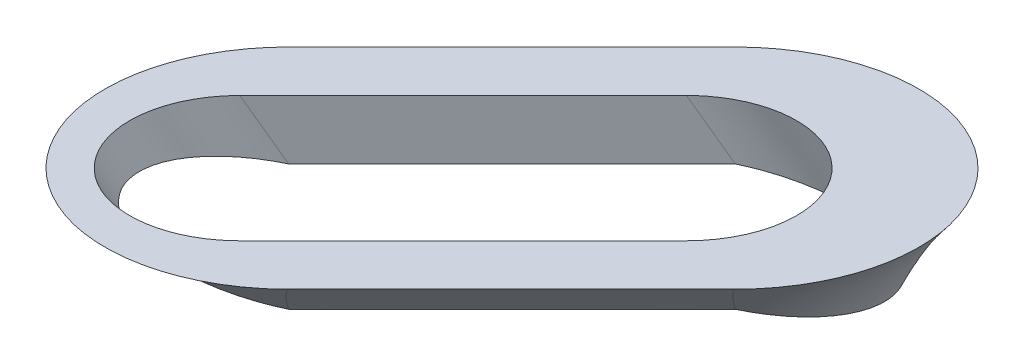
ISO-10303-21;
HEADER;
FILE_DESCRIPTION(('STEP AP214'),'2;1');
FILE_NAME('part.step','',(''),(''),'','','');
FILE_SCHEMA(('AUTOMOTIVE_DESIGN { 1 0 10303 214 1 1 1 1 }'));
ENDSEC;
DATA;
#1=APPLICATION_CONTEXT('core data for automotive mechanical design processes');
#2=APPLICATION_PROTOCOL_DEFINITION('international standard','automotive_design',2000,#1);
#3=PRODUCT_CONTEXT('',#1,'mechanical');
#4=PRODUCT('Part','Part','',(#3));
#5=PRODUCT_RELATED_PRODUCT_CATEGORY('part','',(#4));
#6=PRODUCT_DEFINITION_FORMATION('','',#4);
#7=PRODUCT_DEFINITION_CONTEXT('part definition',#1,'design');
#8=PRODUCT_DEFINITION('design','',#6,#7);
#9=PRODUCT_DEFINITION_SHAPE('','',#8);
#10=(LENGTH_UNIT() NAMED_UNIT(*) SI_UNIT(.MILLI.,.METRE.));
#11=(NAMED_UNIT(*) PLANE_ANGLE_UNIT() SI_UNIT($,.RADIAN.));
#12=(NAMED_UNIT(*) SI_UNIT($,.STERADIAN.) SOLID_ANGLE_UNIT());
#13=UNCERTAINTY_MEASURE_WITH_UNIT(LENGTH_MEASURE(1.E-05),#10,'distance_accuracy_value','');
#14=(GEOMETRIC_REPRESENTATION_CONTEXT(3) GLOBAL_UNCERTAINTY_ASSIGNED_CONTEXT((#13)) GLOBAL_UNIT_ASSIGNED_CONTEXT((#10,
#11,#12)) REPRESENTATION_CONTEXT('',''));
#15=CARTESIAN_POINT('',(0.,0.,0.));
#16=DIRECTION('',(0.,0.,1.));
#17=DIRECTION('',(1.,0.,0.));
#18=AXIS2_PLACEMENT_3D('',#15,#16,#17);
#19=CARTESIAN_POINT('',(-189.631749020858,512.262257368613,189.631749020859));
#20=DIRECTION('',(0.35568881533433,-0.864274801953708,-0.355688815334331));
#21=DIRECTION('',(-0.707106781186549,0.,-0.707106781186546));
#22=AXIS2_PLACEMENT_3D('',#19,#20,#21);
#23=CYLINDRICAL_SURFACE('',#22,7.5);
#24=CARTESIAN_POINT('',(-170.837042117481,479.480000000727,181.443643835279));
#25=CARTESIAN_POINT('',(-170.791298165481,479.464756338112,181.39789248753));
#26=CARTESIAN_POINT('',(-170.745966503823,479.448994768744,181.351909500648));
#27=CARTESIAN_POINT('',(-170.656042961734,479.416952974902,181.25940328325));
#28=CARTESIAN_POINT('',(-170.611451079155,479.400672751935,181.212880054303));
#29=CARTESIAN_POINT('',(-170.522921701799,479.36811059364,181.119215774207));
#30=CARTESIAN_POINT('',(-170.47898421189,479.3518286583,181.072074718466));
#31=CARTESIAN_POINT('',(-170.39174020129,479.319519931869,180.977125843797));
#32=CARTESIAN_POINT('',(-170.348433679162,479.303493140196,180.929318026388));
#33=CARTESIAN_POINT('',(-170.262434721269,479.271511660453,180.833011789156));
#34=CARTESIAN_POINT('',(-170.219743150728,479.25555709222,180.784512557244));
#35=CARTESIAN_POINT('',(-170.135053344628,479.223653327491,180.686910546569));
#36=CARTESIAN_POINT('',(-170.093055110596,479.207704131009,180.637807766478));
#37=CARTESIAN_POINT('',(-170.009764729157,479.17578423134,180.539013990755));
#38=CARTESIAN_POINT('',(-169.968472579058,479.159813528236,180.489322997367));
#39=CARTESIAN_POINT('',(-169.886600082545,479.127892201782,180.389352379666));
#40=CARTESIAN_POINT('',(-169.846019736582,479.111941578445,180.339072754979));
#41=CARTESIAN_POINT('',(-169.725317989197,479.064148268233,180.187299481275));
#42=CARTESIAN_POINT('',(-169.646276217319,479.032379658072,180.084919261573));
#43=CARTESIAN_POINT('',(-169.491180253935,478.969014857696,179.877875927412));
#44=CARTESIAN_POINT('',(-169.415126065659,478.937418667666,179.773212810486));
#45=CARTESIAN_POINT('',(-169.190204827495,478.8422237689,179.453942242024));
#46=CARTESIAN_POINT('',(-169.046064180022,478.778803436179,179.235917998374));
#47=CARTESIAN_POINT('',(-168.771271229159,478.652691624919,178.791463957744));
#48=CARTESIAN_POINT('',(-168.640613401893,478.589999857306,178.565037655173));
#49=CARTESIAN_POINT('',(-168.393775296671,478.465799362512,178.10421249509));
#50=CARTESIAN_POINT('',(-168.277589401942,478.404290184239,177.869816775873));
#51=CARTESIAN_POINT('',(-168.054635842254,478.279266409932,177.37989159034));
#52=CARTESIAN_POINT('',(-167.94878690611,478.215838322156,177.123920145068));
#53=CARTESIAN_POINT('',(-167.756164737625,478.090964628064,176.604401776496));
#54=CARTESIAN_POINT('',(-167.669390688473,478.029518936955,176.34085517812));
#55=CARTESIAN_POINT('',(-167.517179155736,477.909699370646,175.807819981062));
#56=CARTESIAN_POINT('',(-167.451680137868,477.85131705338,175.538350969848));
#57=CARTESIAN_POINT('',(-167.343802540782,477.737625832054,174.994183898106));
#58=CARTESIAN_POINT('',(-167.301417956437,477.682316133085,174.719487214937));
#59=CARTESIAN_POINT('',(-167.249771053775,477.589053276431,174.238292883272));
#60=CARTESIAN_POINT('',(-167.234773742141,477.550314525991,174.032555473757));
#61=CARTESIAN_POINT('',(-167.219765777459,477.474985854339,173.620122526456));
#62=CARTESIAN_POINT('',(-167.219754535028,477.438395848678,173.413427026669));
#63=CARTESIAN_POINT('',(-167.235973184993,477.368070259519,173.000311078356));
#64=CARTESIAN_POINT('',(-167.252188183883,477.334332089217,172.793890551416));
#65=CARTESIAN_POINT('',(-167.289793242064,477.286688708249,172.48547315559));
#66=CARTESIAN_POINT('',(-167.304542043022,477.271301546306,172.382869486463));
#67=CARTESIAN_POINT('',(-167.338650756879,477.2416447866,172.178271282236));
#68=CARTESIAN_POINT('',(-167.358010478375,477.22737514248,172.076276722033));
#69=CARTESIAN_POINT('',(-167.415299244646,477.191102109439,171.808158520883));
#70=CARTESIAN_POINT('',(-167.457185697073,477.169989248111,171.642739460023));
#71=CARTESIAN_POINT('',(-167.553890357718,477.130624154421,171.315383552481));
#72=CARTESIAN_POINT('',(-167.608708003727,477.11237179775,171.153446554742));
#73=CARTESIAN_POINT('',(-167.731431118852,477.078704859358,170.834302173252));
#74=CARTESIAN_POINT('',(-167.799335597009,477.063290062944,170.677094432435));
#75=CARTESIAN_POINT('',(-167.948259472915,477.035373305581,170.368714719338));
#76=CARTESIAN_POINT('',(-168.029279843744,477.022871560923,170.217543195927));
#77=CARTESIAN_POINT('',(-168.205002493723,477.001036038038,169.921595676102));
#78=CARTESIAN_POINT('',(-168.299801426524,476.991726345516,169.776875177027));
#79=CARTESIAN_POINT('',(-168.50236812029,476.976891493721,169.496571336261));
#80=CARTESIAN_POINT('',(-168.610133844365,476.971365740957,169.360986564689));
#81=CARTESIAN_POINT('',(-168.781018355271,476.966422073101,169.16576661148));
#82=CARTESIAN_POINT('',(-168.839503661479,476.965331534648,169.102067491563));
#83=CARTESIAN_POINT('',(-168.959494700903,476.964391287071,168.977561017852));
#84=CARTESIAN_POINT('',(-169.02100040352,476.96454156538,168.916753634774));
#85=CARTESIAN_POINT('',(-169.146857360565,476.966053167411,168.798180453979));
#86=CARTESIAN_POINT('',(-169.211208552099,476.967414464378,168.740414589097));
#87=CARTESIAN_POINT('',(-169.34254245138,476.971228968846,168.628003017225));
#88=CARTESIAN_POINT('',(-169.409525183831,476.973682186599,168.573357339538));
#89=CARTESIAN_POINT('',(-169.59667195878,476.981792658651,168.427782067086));
#90=CARTESIAN_POINT('',(-169.719336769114,476.988475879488,168.340094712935));
#91=CARTESIAN_POINT('',(-169.970999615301,477.004519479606,168.174695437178));
#92=CARTESIAN_POINT('',(-170.099997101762,477.013879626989,168.096982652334));
#93=CARTESIAN_POINT('',(-170.363415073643,477.035001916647,167.951592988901));
#94=CARTESIAN_POINT('',(-170.497838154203,477.046765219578,167.883920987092));
#95=CARTESIAN_POINT('',(-170.771108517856,477.072514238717,167.758680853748));
#96=CARTESIAN_POINT('',(-170.909956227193,477.086500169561,167.701113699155));
#97=CARTESIAN_POINT('',(-171.202783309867,477.117927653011,167.591740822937));
#98=CARTESIAN_POINT('',(-171.357065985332,477.135559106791,167.540802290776));
#99=CARTESIAN_POINT('',(-171.668691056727,477.173421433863,167.4506032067));
#100=CARTESIAN_POINT('',(-171.826033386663,477.193652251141,167.411342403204));
#101=CARTESIAN_POINT('',(-172.06356561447,477.225910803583,167.360974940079));
#102=CARTESIAN_POINT('',(-172.143007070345,477.236984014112,167.345604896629));
#103=CARTESIAN_POINT('',(-172.302284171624,477.259800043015,167.317673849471));
#104=CARTESIAN_POINT('',(-172.382119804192,477.271542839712,167.305112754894));
#105=CARTESIAN_POINT('',(-172.622080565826,477.307716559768,167.271528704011));
#106=CARTESIAN_POINT('',(-172.782654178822,477.333092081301,167.254606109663));
#107=CARTESIAN_POINT('',(-173.06537968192,477.379430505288,167.23383015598));
#108=CARTESIAN_POINT('',(-173.187451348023,477.399980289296,167.227808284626));
#109=CARTESIAN_POINT('',(-173.431587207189,477.442010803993,167.221351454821));
#110=CARTESIAN_POINT('',(-173.553651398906,477.463491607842,167.220916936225));
#111=CARTESIAN_POINT('',(-173.919539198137,477.529183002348,167.227633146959));
#112=CARTESIAN_POINT('',(-174.16302751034,477.574637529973,167.242805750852));
#113=CARTESIAN_POINT('',(-174.647948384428,477.668299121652,167.292783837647));
#114=CARTESIAN_POINT('',(-174.889374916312,477.716512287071,167.327634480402));
#115=CARTESIAN_POINT('',(-175.368388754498,477.815368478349,167.415428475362));
#116=CARTESIAN_POINT('',(-175.60597627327,477.866011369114,167.468370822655));
#117=CARTESIAN_POINT('',(-176.000361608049,477.952796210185,167.571089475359));
#118=CARTESIAN_POINT('',(-176.158484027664,477.988342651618,167.616372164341));
#119=CARTESIAN_POINT('',(-176.472280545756,478.060401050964,167.714138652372));
#120=CARTESIAN_POINT('',(-176.627954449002,478.096913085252,167.766623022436));
#121=CARTESIAN_POINT('',(-176.936733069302,478.17067103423,167.878379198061));
#122=CARTESIAN_POINT('',(-177.08983681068,478.207917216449,167.937653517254));
#123=CARTESIAN_POINT('',(-177.393235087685,478.283023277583,168.062613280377));
#124=CARTESIAN_POINT('',(-177.543529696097,478.320883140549,168.128298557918));
#125=CARTESIAN_POINT('',(-177.990126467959,478.435381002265,168.334568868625));
#126=CARTESIAN_POINT('',(-178.282012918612,478.512906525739,168.484321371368));
#127=CARTESIAN_POINT('',(-178.852793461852,478.669495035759,168.805866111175));
#128=CARTESIAN_POINT('',(-179.131691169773,478.748557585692,168.977652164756));
#129=CARTESIAN_POINT('',(-179.495575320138,478.85488374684,169.22099592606));
#130=CARTESIAN_POINT('',(-179.586723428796,478.881794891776,169.283633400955));
#131=CARTESIAN_POINT('',(-179.767403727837,478.935708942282,169.4111602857));
#132=CARTESIAN_POINT('',(-179.856935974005,478.962711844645,169.476049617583));
#133=CARTESIAN_POINT('',(-180.034325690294,479.016827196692,169.608007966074));
#134=CARTESIAN_POINT('',(-180.122183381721,479.043939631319,169.675076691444));
#135=CARTESIAN_POINT('',(-180.252684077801,479.084726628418,169.777270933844));
#136=CARTESIAN_POINT('',(-180.295970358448,479.098342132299,169.811601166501));
#137=CARTESIAN_POINT('',(-180.382113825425,479.125601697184,169.880786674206));
#138=CARTESIAN_POINT('',(-180.424971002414,479.139245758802,169.915641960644));
#139=CARTESIAN_POINT('',(-180.552473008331,479.180047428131,170.020636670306));
#140=CARTESIAN_POINT('',(-180.63648373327,479.207211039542,170.0915460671));
#141=CARTESIAN_POINT('',(-180.802773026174,479.261494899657,170.235383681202));
#142=CARTESIAN_POINT('',(-180.885051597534,479.288615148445,170.308311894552));
#143=CARTESIAN_POINT('',(-181.007058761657,479.329674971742,170.419122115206));
#144=CARTESIAN_POINT('',(-181.047494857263,479.343425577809,170.456297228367));
#145=CARTESIAN_POINT('',(-181.127885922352,479.371090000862,170.531101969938));
#146=CARTESIAN_POINT('',(-181.167840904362,479.385003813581,170.568731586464));
#147=CARTESIAN_POINT('',(-181.247324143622,479.412707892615,170.644484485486));
#148=CARTESIAN_POINT('',(-181.286852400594,479.42649815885,170.682607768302));
#149=CARTESIAN_POINT('',(-181.365525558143,479.453648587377,170.759401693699));
#150=CARTESIAN_POINT('',(-181.404670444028,479.467008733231,170.798072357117));
#151=CARTESIAN_POINT('',(-181.443643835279,479.480000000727,170.837042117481));
#152=B_SPLINE_CURVE_WITH_KNOTS('',3,(#24,#25,#26,#27,#28,#29,#30,#31,#32,#33,#34,#35,#36,#37,
#38,#39,#40,#41,#42,#43,#44,#45,#46,#47,#48,#49,#50,#51,#52,#53,#54,#55,#56,#57,#58,#59,#60,#61,
#62,#63,#64,#65,#66,#67,#68,#69,#70,#71,#72,#73,#74,#75,#76,#77,#78,#79,#80,#81,#82,#83,#84,#85,
#86,#87,#88,#89,#90,#91,#92,#93,#94,#95,#96,#97,#98,#99,#100,#101,#102,#103,#104,#105,#106,#107,
#108,#109,#110,#111,#112,#113,#114,#115,#116,#117,#118,#119,#120,#121,#122,#123,#124,#125,#126,
#127,#128,#129,#130,#131,#132,#133,#134,#135,#136,#137,#138,#139,#140,#141,#142,#143,#144,#145,
#146,#147,#148,#149,#150,#151),.UNSPECIFIED.,.F.,.F.,(4,2,2,2,2,2,2,2,2,2,2,2,2,2,2,2,2,2,2,2,2,
2,2,2,2,2,2,2,2,2,2,2,2,2,2,2,2,2,2,2,2,2,2,2,2,2,2,2,2,2,2,2,2,2,2,2,2,2,2,2,2,2,2,4),(0.,
0.199394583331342,0.398788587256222,0.598184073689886,0.797579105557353,0.997231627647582,
1.19688458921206,1.39653678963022,1.59618911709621,1.99568709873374,2.3951855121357,
3.20153451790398,4.00755184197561,4.81325535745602,5.66504030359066,6.51678876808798,
7.36605129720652,8.21509308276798,8.84426902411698,9.47342022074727,10.1019944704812,
10.4162822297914,10.7305569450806,11.2458264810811,11.7610736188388,12.2762817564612,
12.7915281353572,13.3105809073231,13.8295522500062,14.0889103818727,14.3482658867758,
14.6076156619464,14.8669678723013,15.3192154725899,15.7714239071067,16.2238512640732,
16.6763223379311,17.1661239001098,17.6559149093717,17.900877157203,18.1458314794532,
18.6357567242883,19.0074394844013,19.3791515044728,20.1226682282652,20.8678982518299,
21.6130868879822,22.1177519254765,22.6224570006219,23.1273495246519,23.6322289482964,
24.6424076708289,25.6523035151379,25.9937500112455,26.3351846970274,26.6765739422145,
26.8472714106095,27.0179725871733,27.3576661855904,27.6973591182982,27.8672240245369,
28.0370844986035,28.206945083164,28.3768121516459),.UNSPECIFIED.);
#153=CARTESIAN_POINT('',(-170.837042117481,479.480000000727,181.443643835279));
#154=VERTEX_POINT('',#153);
#155=CARTESIAN_POINT('',(-181.443643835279,479.480000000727,170.837042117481));
#156=VERTEX_POINT('',#155);
#157=EDGE_CURVE('E122',#154,#156,#152,.T.);
#158=ORIENTED_EDGE('',*,*,#157,.F.);
#159=DIRECTION('',(0.35568881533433,-0.864274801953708,-0.355688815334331));
#160=VECTOR('',#159,1.);
#161=CARTESIAN_POINT('',(-184.328448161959,512.262257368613,194.935049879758));
#162=LINE('',#161,#160);
#163=CARTESIAN_POINT('',(-172.89477198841,484.480000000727,183.501373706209));
#164=VERTEX_POINT('',#163);
#165=EDGE_CURVE('E301',#164,#154,#162,.T.);
#166=ORIENTED_EDGE('',*,*,#165,.F.);
#167=CARTESIAN_POINT('',(-178.198072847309,484.480000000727,178.19807284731));
#168=DIRECTION('',(0.,1.,0.));
#169=DIRECTION('',(0.707106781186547,0.,-0.707106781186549));
#170=AXIS2_PLACEMENT_3D('',#167,#168,#169);
#171=ELLIPSE('',#170,8.67779551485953,7.5);
#172=CARTESIAN_POINT('',(-183.501373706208,484.480000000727,172.894771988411));
#173=VERTEX_POINT('',#172);
#174=EDGE_CURVE('E149',#164,#173,#171,.T.);
#175=ORIENTED_EDGE('',*,*,#174,.T.);
#176=DIRECTION('',(0.35568881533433,-0.864274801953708,-0.355688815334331));
#177=VECTOR('',#176,1.);
#178=CARTESIAN_POINT('',(-194.935049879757,512.262257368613,184.32844816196));
#179=LINE('',#178,#177);
#180=EDGE_CURVE('E291',#173,#156,#179,.T.);
#181=ORIENTED_EDGE('',*,*,#180,.T.);
#182=EDGE_LOOP('',(#158,#166,#175,#181));
#183=FACE_BOUND('',#182,.T.);
#184=ADVANCED_FACE('F67',(#183),#23,.F.);
#185=CARTESIAN_POINT('',(-184.328448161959,512.262257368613,194.935049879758));
#186=DIRECTION('',(-0.707106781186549,0.,-0.707106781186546));
#187=DIRECTION('',(-0.35568881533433,0.864274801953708,0.355688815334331));
#188=AXIS2_PLACEMENT_3D('',#185,#186,#187);
#189=PLANE('',#188);
#190=DIRECTION('',(-0.35568881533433,0.864274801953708,0.355688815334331));
#191=VECTOR('',#190,1.);
#192=CARTESIAN_POINT('',(-198.384543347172,500.692798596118,208.991145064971));
#193=LINE('',#192,#191);
#194=CARTESIAN_POINT('',(-191.712231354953,484.480000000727,202.318833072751));
#195=VERTEX_POINT('',#194);
#196=CARTESIAN_POINT('',(-189.654501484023,479.480000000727,200.261103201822));
#197=VERTEX_POINT('',#196);
#198=EDGE_CURVE('E133',#195,#197,#193,.F.);
#199=ORIENTED_EDGE('',*,*,#198,.F.);
#200=DIRECTION('',(0.707106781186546,0.,-0.707106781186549));
#201=VECTOR('',#200,1.);
#202=CARTESIAN_POINT('',(-184.328448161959,484.480000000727,194.935049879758));
#203=LINE('',#202,#201);
#204=EDGE_CURVE('E132',#195,#164,#203,.T.);
#205=ORIENTED_EDGE('',*,*,#204,.T.);
#206=ORIENTED_EDGE('',*,*,#165,.T.);
#207=CARTESIAN_POINT('',(-189.654501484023,479.480000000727,200.261103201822));
#208=CARTESIAN_POINT('',(-188.814780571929,479.480014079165,199.421382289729));
#209=CARTESIAN_POINT('',(-187.975059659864,479.480007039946,198.581661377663));
#210=CARTESIAN_POINT('',(-186.295617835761,479.479992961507,196.90221955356));
#211=CARTESIAN_POINT('',(-185.455896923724,479.479985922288,196.062498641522));
#212=CARTESIAN_POINT('',(-183.776455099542,479.480014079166,194.383056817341));
#213=CARTESIAN_POINT('',(-182.936734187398,479.480049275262,193.543335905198));
#214=CARTESIAN_POINT('',(-181.677152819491,479.480022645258,192.283754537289));
#215=CARTESIAN_POINT('',(-181.257292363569,479.480000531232,191.863894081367));
#216=CARTESIAN_POINT('',(-180.417571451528,479.479988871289,191.024173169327));
#217=CARTESIAN_POINT('',(-179.997710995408,479.479999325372,190.604312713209));
#218=CARTESIAN_POINT('',(-178.849449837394,479.479991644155,189.456051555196));
#219=CARTESIAN_POINT('',(-178.121049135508,479.47994685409,188.727650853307));
#220=CARTESIAN_POINT('',(-177.028448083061,479.479969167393,187.63504980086));
#221=CARTESIAN_POINT('',(-176.66424773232,479.479991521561,187.270849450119));
#222=CARTESIAN_POINT('',(-175.935847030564,479.480008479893,186.542448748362));
#223=CARTESIAN_POINT('',(-175.571646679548,479.480003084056,186.178248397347));
#224=CARTESIAN_POINT('',(-174.479045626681,479.479993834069,185.08564734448));
#225=CARTESIAN_POINT('',(-173.750644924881,479.479996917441,184.35724664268));
#226=CARTESIAN_POINT('',(-172.293843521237,479.480003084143,182.900445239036));
#227=CARTESIAN_POINT('',(-171.565442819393,479.480006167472,182.172044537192));
#228=CARTESIAN_POINT('',(-170.837042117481,479.480000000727,181.443643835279));
#229=B_SPLINE_CURVE_WITH_KNOTS('',3,(#207,#208,#209,#210,#211,#212,#213,#214,#215,#216,#217,
#218,#219,#220,#221,#222,#223,#224,#225,#226,#227,#228),.UNSPECIFIED.,.F.,.F.,(4,2,2,2,2,2,2,2,
2,2,4),(0.,3.56263410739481,7.12526821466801,10.6879023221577,12.469219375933,14.2505364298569,
17.3408788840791,18.8860501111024,20.431221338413,23.5215637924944,26.6119062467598),.UNSPECIFIED.);
#230=EDGE_CURVE('E143',#197,#154,#229,.T.);
#231=ORIENTED_EDGE('',*,*,#230,.F.);
#232=EDGE_LOOP('',(#199,#205,#206,#231));
#233=FACE_BOUND('',#232,.T.);
#234=ADVANCED_FACE('F290',(#233),#189,.T.);
#235=CARTESIAN_POINT('',(-203.687844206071,500.692798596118,203.687844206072));
#236=DIRECTION('',(0.35568881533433,-0.864274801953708,-0.355688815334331));
#237=DIRECTION('',(-0.707106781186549,0.,-0.707106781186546));
#238=AXIS2_PLACEMENT_3D('',#235,#236,#237);
#239=CYLINDRICAL_SURFACE('',#238,7.5);
#240=CARTESIAN_POINT('',(-200.261103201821,479.480000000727,189.654501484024));
#241=CARTESIAN_POINT('',(-200.306066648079,479.496555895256,189.69945813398));
#242=CARTESIAN_POINT('',(-200.350804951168,479.512608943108,189.744817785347));
#243=CARTESIAN_POINT('',(-200.439730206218,479.544199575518,189.836251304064));
#244=CARTESIAN_POINT('',(-200.483917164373,479.559737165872,189.882325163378));
#245=CARTESIAN_POINT('',(-200.571639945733,479.590787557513,189.975096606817));
#246=CARTESIAN_POINT('',(-200.615175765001,479.60630035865,190.021794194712));
#247=CARTESIAN_POINT('',(-200.701554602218,479.637560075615,190.115748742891));
#248=CARTESIAN_POINT('',(-200.744397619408,479.653306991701,190.16300570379));
#249=CARTESIAN_POINT('',(-200.82946428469,479.684891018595,190.258161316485));
#250=CARTESIAN_POINT('',(-200.871687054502,479.700728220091,190.306060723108));
#251=CARTESIAN_POINT('',(-200.955458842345,479.732383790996,190.402451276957));
#252=CARTESIAN_POINT('',(-200.997007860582,479.74820216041,190.450942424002));
#253=CARTESIAN_POINT('',(-201.079425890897,479.779780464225,190.548518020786));
#254=CARTESIAN_POINT('',(-201.120294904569,479.795540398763,190.597602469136));
#255=CARTESIAN_POINT('',(-201.201337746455,479.827035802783,190.696349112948));
#256=CARTESIAN_POINT('',(-201.241511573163,479.842771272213,190.746011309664));
#257=CARTESIAN_POINT('',(-201.361013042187,479.889992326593,190.895895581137));
#258=CARTESIAN_POINT('',(-201.439280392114,479.921477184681,190.996967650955));
#259=CARTESIAN_POINT('',(-201.592901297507,479.984379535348,191.201315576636));
#260=CARTESIAN_POINT('',(-201.668254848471,480.015797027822,191.304591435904));
#261=CARTESIAN_POINT('',(-201.891322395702,480.110427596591,191.619802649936));
#262=CARTESIAN_POINT('',(-202.034433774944,480.173380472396,191.835106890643));
#263=CARTESIAN_POINT('',(-202.307488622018,480.298266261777,192.274054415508));
#264=CARTESIAN_POINT('',(-202.437437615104,480.360199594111,192.497694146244));
#265=CARTESIAN_POINT('',(-202.683206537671,480.482988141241,192.952783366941));
#266=CARTESIAN_POINT('',(-202.799032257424,480.54384378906,193.18422960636));
#267=CARTESIAN_POINT('',(-203.022983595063,480.66841419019,193.670734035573));
#268=CARTESIAN_POINT('',(-203.1300233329,480.732035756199,193.926318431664));
#269=CARTESIAN_POINT('',(-203.325093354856,480.857228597,194.445170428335));
#270=CARTESIAN_POINT('',(-203.413123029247,480.918799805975,194.708438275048));
#271=CARTESIAN_POINT('',(-203.568153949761,481.039658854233,195.24064197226));
#272=CARTESIAN_POINT('',(-203.635224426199,481.098953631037,195.50955596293));
#273=CARTESIAN_POINT('',(-203.746471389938,481.214433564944,196.052733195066));
#274=CARTESIAN_POINT('',(-203.790655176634,481.270619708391,196.326994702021));
#275=CARTESIAN_POINT('',(-203.845711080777,481.365390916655,196.810981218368));
#276=CARTESIAN_POINT('',(-203.862117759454,481.40489364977,197.019900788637));
#277=CARTESIAN_POINT('',(-203.879216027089,481.481034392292,197.438918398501));
#278=CARTESIAN_POINT('',(-203.8799087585,481.517672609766,197.649016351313));
#279=CARTESIAN_POINT('',(-203.864445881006,481.587902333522,198.069058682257));
#280=CARTESIAN_POINT('',(-203.848297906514,481.621495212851,198.279003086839));
#281=CARTESIAN_POINT('',(-203.810829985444,481.669753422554,198.592608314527));
#282=CARTESIAN_POINT('',(-203.796131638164,481.685485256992,198.696931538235));
#283=CARTESIAN_POINT('',(-203.762230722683,481.716265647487,198.904949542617));
#284=CARTESIAN_POINT('',(-203.743028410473,481.731314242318,199.008644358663));
#285=CARTESIAN_POINT('',(-203.704536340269,481.757419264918,199.193101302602));
#286=CARTESIAN_POINT('',(-203.686142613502,481.768641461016,199.274027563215));
#287=CARTESIAN_POINT('',(-203.646374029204,481.790474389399,199.435221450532));
#288=CARTESIAN_POINT('',(-203.624999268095,481.801085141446,199.515489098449));
#289=CARTESIAN_POINT('',(-203.55630870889,481.831921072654,199.755090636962));
#290=CARTESIAN_POINT('',(-203.504416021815,481.851157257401,199.913274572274));
#291=CARTESIAN_POINT('',(-203.387965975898,481.88634671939,200.225123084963));
#292=CARTESIAN_POINT('',(-203.323420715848,481.902303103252,200.378791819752));
#293=CARTESIAN_POINT('',(-203.181337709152,481.930436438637,200.680375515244));
#294=CARTESIAN_POINT('',(-203.103800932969,481.942613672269,200.828290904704));
#295=CARTESIAN_POINT('',(-202.935389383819,481.963079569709,201.117763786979));
#296=CARTESIAN_POINT('',(-202.84444058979,481.971345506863,201.259279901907));
#297=CARTESIAN_POINT('',(-202.650066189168,481.983969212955,201.533687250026));
#298=CARTESIAN_POINT('',(-202.546638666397,481.988326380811,201.666577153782));
#299=CARTESIAN_POINT('',(-202.328299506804,481.993697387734,201.922672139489));
#300=CARTESIAN_POINT('',(-202.213384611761,481.994710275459,202.045874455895));
#301=CARTESIAN_POINT('',(-201.973301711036,481.994147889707,202.281831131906));
#302=CARTESIAN_POINT('',(-201.848134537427,481.992572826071,202.394586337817));
#303=CARTESIAN_POINT('',(-201.597893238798,481.986133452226,202.600448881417));
#304=CARTESIAN_POINT('',(-201.47350158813,481.9815219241,202.694393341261));
#305=CARTESIAN_POINT('',(-201.217468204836,481.968937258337,202.871513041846));
#306=CARTESIAN_POINT('',(-201.085827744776,481.96096470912,202.95469016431));
#307=CARTESIAN_POINT('',(-200.816419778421,481.941602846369,203.109859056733));
#308=CARTESIAN_POINT('',(-200.678654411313,481.930214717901,203.181854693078));
#309=CARTESIAN_POINT('',(-200.398104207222,481.904164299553,203.314599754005));
#310=CARTESIAN_POINT('',(-200.255318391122,481.889501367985,203.375346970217));
#311=CARTESIAN_POINT('',(-199.931421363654,481.853515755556,203.498968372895));
#312=CARTESIAN_POINT('',(-199.749269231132,481.831438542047,203.558914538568));
#313=CARTESIAN_POINT('',(-199.473041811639,481.795766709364,203.636748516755));
#314=CARTESIAN_POINT('',(-199.380443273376,481.783446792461,203.66068330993));
#315=CARTESIAN_POINT('',(-199.194419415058,481.758010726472,203.704621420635));
#316=CARTESIAN_POINT('',(-199.100994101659,481.744894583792,203.72462476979));
#317=CARTESIAN_POINT('',(-198.913355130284,481.71796151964,203.760854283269));
#318=CARTESIAN_POINT('',(-198.819140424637,481.704143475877,203.777074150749));
#319=CARTESIAN_POINT('',(-198.630241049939,481.67592439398,203.80581814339));
#320=CARTESIAN_POINT('',(-198.535556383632,481.661523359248,203.818342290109));
#321=CARTESIAN_POINT('',(-198.251048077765,481.617409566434,203.850465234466));
#322=CARTESIAN_POINT('',(-198.060731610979,481.586780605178,203.864621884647));
#323=CARTESIAN_POINT('',(-197.619897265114,481.512986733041,203.881382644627));
#324=CARTESIAN_POINT('',(-197.369338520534,481.4689165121,203.87892985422));
#325=CARTESIAN_POINT('',(-196.870116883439,481.376879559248,203.852020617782));
#326=CARTESIAN_POINT('',(-196.621454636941,481.328911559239,203.827556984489));
#327=CARTESIAN_POINT('',(-196.127364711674,481.229770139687,203.75862701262));
#328=CARTESIAN_POINT('',(-195.881940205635,481.178593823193,203.71414236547));
#329=CARTESIAN_POINT('',(-195.395641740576,481.07389726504,203.607051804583));
#330=CARTESIAN_POINT('',(-195.15476794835,481.020376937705,203.544445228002));
#331=CARTESIAN_POINT('',(-194.591656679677,480.891904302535,203.37689221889));
#332=CARTESIAN_POINT('',(-194.271674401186,480.816233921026,203.26482772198));
#333=CARTESIAN_POINT('',(-193.8006446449,480.700533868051,203.076048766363));
#334=CARTESIAN_POINT('',(-193.64507977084,480.66158936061,203.009652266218));
#335=CARTESIAN_POINT('',(-193.337048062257,480.583132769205,202.87032513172));
#336=CARTESIAN_POINT('',(-193.184581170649,480.543620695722,202.797394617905));
#337=CARTESIAN_POINT('',(-192.731886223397,480.424310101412,202.569197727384));
#338=CARTESIAN_POINT('',(-192.436514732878,480.34377438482,202.404586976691));
#339=CARTESIAN_POINT('',(-191.860164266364,480.181015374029,202.052872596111));
#340=CARTESIAN_POINT('',(-191.579180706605,480.09879262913,201.865776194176));
#341=CARTESIAN_POINT('',(-191.158711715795,479.97150005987,201.562155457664));
#342=CARTESIAN_POINT('',(-191.013790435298,479.926803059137,201.452928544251));
#343=CARTESIAN_POINT('',(-190.799806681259,479.859777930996,201.28478978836));
#344=CARTESIAN_POINT('',(-190.729050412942,479.837441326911,201.228031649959));
#345=CARTESIAN_POINT('',(-190.588700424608,479.792722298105,201.113110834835));
#346=CARTESIAN_POINT('',(-190.519106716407,479.770339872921,201.05494814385));
#347=CARTESIAN_POINT('',(-190.381429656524,479.725550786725,200.937522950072));
#348=CARTESIAN_POINT('',(-190.313340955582,479.703144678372,200.87826650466));
#349=CARTESIAN_POINT('',(-190.178329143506,479.658426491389,200.758404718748));
#350=CARTESIAN_POINT('',(-190.111406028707,479.636114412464,200.697799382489));
#351=CARTESIAN_POINT('',(-190.011861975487,479.602986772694,200.605848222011));
#352=CARTESIAN_POINT('',(-189.978817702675,479.591999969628,200.575021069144));
#353=CARTESIAN_POINT('',(-189.913037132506,479.570032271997,200.513037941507));
#354=CARTESIAN_POINT('',(-189.880300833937,479.559051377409,200.481881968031));
#355=CARTESIAN_POINT('',(-189.815169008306,479.536931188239,200.419271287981));
#356=CARTESIAN_POINT('',(-189.782773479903,479.525791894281,200.387816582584));
#357=CARTESIAN_POINT('',(-189.718352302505,479.503184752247,200.324645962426));
#358=CARTESIAN_POINT('',(-189.686326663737,479.491716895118,200.292930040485));
#359=CARTESIAN_POINT('',(-189.654501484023,479.480000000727,200.261103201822));
#360=B_SPLINE_CURVE_WITH_KNOTS('',3,(#240,#241,#242,#243,#244,#245,#246,#247,#248,#249,#250,
#251,#252,#253,#254,#255,#256,#257,#258,#259,#260,#261,#262,#263,#264,#265,#266,#267,#268,#269,
#270,#271,#272,#273,#274,#275,#276,#277,#278,#279,#280,#281,#282,#283,#284,#285,#286,#287,#288,
#289,#290,#291,#292,#293,#294,#295,#296,#297,#298,#299,#300,#301,#302,#303,#304,#305,#306,#307,
#308,#309,#310,#311,#312,#313,#314,#315,#316,#317,#318,#319,#320,#321,#322,#323,#324,#325,#326,
#327,#328,#329,#330,#331,#332,#333,#334,#335,#336,#337,#338,#339,#340,#341,#342,#343,#344,#345,
#346,#347,#348,#349,#350,#351,#352,#353,#354,#355,#356,#357,#358,#359),.UNSPECIFIED.,.F.,.F.,(4,
2,2,2,2,2,2,2,2,2,2,2,2,2,2,2,2,2,2,2,2,2,2,2,2,2,2,2,2,2,2,2,2,2,2,2,2,2,2,2,2,2,2,2,2,2,2,2,2,
2,2,2,2,2,2,2,2,2,2,4),(0.,0.197099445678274,0.394196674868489,0.591295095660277,
0.788393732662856,0.985748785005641,1.1831037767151,1.38045830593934,1.57781326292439,
1.97271597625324,2.36761929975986,3.16538436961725,3.96281315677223,4.75991390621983,
5.61211977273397,6.46435296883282,7.31374064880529,8.16285726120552,8.80208021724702,
9.44125669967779,10.0801435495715,10.3996283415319,10.7190949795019,10.9702754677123,
11.2214478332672,11.7236338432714,12.2253419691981,12.7270126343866,13.2315635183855,
13.7361919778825,14.2409639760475,14.7456950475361,15.2129681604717,15.6801595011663,
16.1471889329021,16.6143099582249,17.1924884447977,17.4817182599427,17.7709457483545,
18.0606512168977,18.3503549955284,18.9296440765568,19.6917813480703,20.4541675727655,
21.21725239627,21.9803651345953,23.0208994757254,23.541480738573,24.0620523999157,
25.1036948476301,26.1450033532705,26.7055622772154,26.9857988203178,27.2660382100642,
27.5450285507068,27.8240180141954,27.9635386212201,28.1030586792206,28.2425781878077,
28.3821015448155),.UNSPECIFIED.);
#361=CARTESIAN_POINT('',(-200.261103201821,479.480000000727,189.654501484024));
#362=VERTEX_POINT('',#361);
#363=EDGE_CURVE('E136',#362,#197,#360,.T.);
#364=ORIENTED_EDGE('',*,*,#363,.F.);
#365=DIRECTION('',(0.35568881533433,-0.864274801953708,-0.355688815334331));
#366=VECTOR('',#365,1.);
#367=CARTESIAN_POINT('',(-208.99114506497,500.692798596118,198.384543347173));
#368=LINE('',#367,#366);
#369=CARTESIAN_POINT('',(-202.318833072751,484.480000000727,191.712231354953));
#370=VERTEX_POINT('',#369);
#371=EDGE_CURVE('E125',#370,#362,#368,.T.);
#372=ORIENTED_EDGE('',*,*,#371,.F.);
#373=CARTESIAN_POINT('',(-197.015532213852,484.480000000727,197.015532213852));
#374=DIRECTION('',(0.,1.,0.));
#375=DIRECTION('',(0.707106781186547,0.,-0.707106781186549));
#376=AXIS2_PLACEMENT_3D('',#373,#374,#375);
#377=ELLIPSE('',#376,8.67779551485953,7.5);
#378=EDGE_CURVE('E284',#370,#195,#377,.T.);
#379=ORIENTED_EDGE('',*,*,#378,.T.);
#380=ORIENTED_EDGE('',*,*,#198,.T.);
#381=EDGE_LOOP('',(#364,#372,#379,#380));
#382=FACE_BOUND('',#381,.T.);
#383=ADVANCED_FACE('F137',(#382),#239,.F.);
#384=CARTESIAN_POINT('',(-194.935049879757,512.262257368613,184.32844816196));
#385=DIRECTION('',(0.707106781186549,0.,0.707106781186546));
#386=DIRECTION('',(0.35568881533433,-0.864274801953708,-0.355688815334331));
#387=AXIS2_PLACEMENT_3D('',#384,#385,#386);
#388=PLANE('',#387);
#389=ORIENTED_EDGE('',*,*,#180,.F.);
#390=DIRECTION('',(-0.707106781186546,0.,0.707106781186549));
#391=VECTOR('',#390,1.);
#392=CARTESIAN_POINT('',(-194.935049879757,484.480000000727,184.32844816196));
#393=LINE('',#392,#391);
#394=EDGE_CURVE('E129',#173,#370,#393,.T.);
#395=ORIENTED_EDGE('',*,*,#394,.T.);
#396=ORIENTED_EDGE('',*,*,#371,.T.);
#397=CARTESIAN_POINT('',(-181.443643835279,479.480000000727,170.837042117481));
#398=CARTESIAN_POINT('',(-183.123155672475,479.48000124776,172.516553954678));
#399=CARTESIAN_POINT('',(-184.802667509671,479.480000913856,174.196065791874));
#400=CARTESIAN_POINT('',(-188.161691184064,479.479999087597,177.555089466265));
#401=CARTESIAN_POINT('',(-189.84120302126,479.479997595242,179.234601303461));
#402=CARTESIAN_POINT('',(-194.434177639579,479.479994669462,183.827575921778));
#403=CARTESIAN_POINT('',(-197.347640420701,479.4799940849,186.7410387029));
#404=CARTESIAN_POINT('',(-200.261103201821,479.480000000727,189.654501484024));
#405=B_SPLINE_CURVE_WITH_KNOTS('',3,(#397,#398,#399,#400,#401,#402,#403,#404),.UNSPECIFIED.,.F.,
.F.,(4,2,2,4),(0.,7.12556525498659,14.2511305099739,26.6119062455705),.UNSPECIFIED.);
#406=EDGE_CURVE('E111',#156,#362,#405,.T.);
#407=ORIENTED_EDGE('',*,*,#406,.F.);
#408=EDGE_LOOP('',(#389,#395,#396,#407));
#409=FACE_BOUND('',#408,.T.);
#410=ADVANCED_FACE('F69',(#409),#388,.T.);
#411=CARTESIAN_POINT('',(136.966061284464,484.480000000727,0.));
#412=DIRECTION('',(0.,1.,0.));
#413=DIRECTION('',(0.,0.,-1.));
#414=AXIS2_PLACEMENT_3D('',#411,#412,#413);
#415=PLANE('',#414);
#416=CARTESIAN_POINT('',(-184.972359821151,484.480000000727,167.294690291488));
#417=CARTESIAN_POINT('',(-185.812112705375,484.480000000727,168.134449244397));
#418=CARTESIAN_POINT('',(-186.651869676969,484.480000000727,168.974204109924));
#419=CARTESIAN_POINT('',(-188.331384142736,484.480000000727,170.653713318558));
#420=CARTESIAN_POINT('',(-189.17114163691,484.480000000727,171.493467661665));
#421=CARTESIAN_POINT('',(-190.850649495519,484.480000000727,173.172983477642));
#422=CARTESIAN_POINT('',(-191.690399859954,484.480000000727,174.012744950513));
#423=CARTESIAN_POINT('',(-193.369909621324,484.480000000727,175.692258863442));
#424=CARTESIAN_POINT('',(-194.209669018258,484.480000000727,176.532011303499));
#425=CARTESIAN_POINT('',(-195.414184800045,484.480000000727,177.736509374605));
#426=CARTESIAN_POINT('',(-195.778938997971,484.480000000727,178.10125719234));
#427=CARTESIAN_POINT('',(-196.326035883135,484.480000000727,178.648413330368));
#428=CARTESIAN_POINT('',(-196.508395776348,484.480000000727,178.830804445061));
#429=CARTESIAN_POINT('',(-196.873149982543,484.480000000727,179.195552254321));
#430=CARTESIAN_POINT('',(-197.055544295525,484.480000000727,179.377908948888));
#431=CARTESIAN_POINT('',(-197.420311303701,484.480000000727,179.742643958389));
#432=CARTESIAN_POINT('',(-197.602683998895,484.480000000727,179.925022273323));
#433=CARTESIAN_POINT('',(-197.967416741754,484.480000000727,180.289791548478));
#434=CARTESIAN_POINT('',(-198.149776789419,484.480000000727,180.4721825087));
#435=CARTESIAN_POINT('',(-198.696891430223,484.480000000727,181.019320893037));
#436=CARTESIAN_POINT('',(-199.061680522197,484.480000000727,181.384033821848));
#437=CARTESIAN_POINT('',(-199.791359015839,484.480000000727,182.113359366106));
#438=CARTESIAN_POINT('',(-200.156248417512,484.480000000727,182.47797198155));
#439=CARTESIAN_POINT('',(-200.70339975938,484.480000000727,183.025073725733));
#440=CARTESIAN_POINT('',(-200.885753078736,484.480000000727,183.207471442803));
#441=CARTESIAN_POINT('',(-201.250350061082,484.480000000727,183.572376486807));
#442=CARTESIAN_POINT('',(-201.43259372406,484.480000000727,183.754883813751));
#443=CARTESIAN_POINT('',(-201.705889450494,484.480000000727,184.028714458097));
#444=CARTESIAN_POINT('',(-201.796976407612,484.480000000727,184.120002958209));
#445=CARTESIAN_POINT('',(-201.979165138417,484.480000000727,184.302565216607));
#446=CARTESIAN_POINT('',(-202.070266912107,484.480000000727,184.393838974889));
#447=CARTESIAN_POINT('',(-202.252490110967,484.480000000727,184.576366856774));
#448=CARTESIAN_POINT('',(-202.343611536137,484.480000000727,184.667620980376));
#449=CARTESIAN_POINT('',(-202.525885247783,484.480000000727,184.850098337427));
#450=CARTESIAN_POINT('',(-202.617037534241,484.480000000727,184.941321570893));
#451=CARTESIAN_POINT('',(-202.79948992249,484.480000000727,185.123620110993));
#452=CARTESIAN_POINT('',(-202.890790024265,484.480000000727,185.214695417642));
#453=CARTESIAN_POINT('',(-203.073498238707,484.480000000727,185.396737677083));
#454=CARTESIAN_POINT('',(-203.164906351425,484.480000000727,185.487704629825));
#455=CARTESIAN_POINT('',(-203.347558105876,484.480000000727,185.66980360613));
#456=CARTESIAN_POINT('',(-203.438801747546,484.480000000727,185.760935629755));
#457=CARTESIAN_POINT('',(-203.621188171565,484.480000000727,185.943300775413));
#458=CARTESIAN_POINT('',(-203.712330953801,484.480000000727,186.034533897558));
#459=CARTESIAN_POINT('',(-203.803455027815,484.480000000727,186.125785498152));
#460=B_SPLINE_CURVE_WITH_KNOTS('',3,(#416,#417,#418,#419,#420,#421,#422,#423,#424,#425,#426,
#427,#428,#429,#430,#431,#432,#433,#434,#435,#436,#437,#438,#439,#440,#441,#442,#443,#444,#445,
#446,#447,#448,#449,#450,#451,#452,#453,#454,#455,#456,#457,#458,#459),.UNSPECIFIED.,.F.,.F.,(4,
2,2,2,2,2,2,2,2,2,2,2,2,2,2,2,2,2,2,2,2,4),(0.,3.56278262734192,7.12556525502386,
10.6883478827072,14.2511305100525,15.7986379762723,16.5723917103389,17.3461454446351,
18.1198991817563,18.893652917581,20.4411603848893,21.9886679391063,22.7624217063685,
23.5361755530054,23.923052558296,24.3099296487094,24.696806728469,25.0836835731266,
25.4705603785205,25.8574373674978,26.2443145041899,26.6311920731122),.UNSPECIFIED.);
#461=CARTESIAN_POINT('',(-184.972359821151,484.480000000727,167.294690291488));
#462=VERTEX_POINT('',#461);
#463=CARTESIAN_POINT('',(-203.803455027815,484.480000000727,186.125785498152));
#464=VERTEX_POINT('',#463);
#465=EDGE_CURVE('E12',#462,#464,#460,.T.);
#466=ORIENTED_EDGE('',*,*,#465,.T.);
#467=CARTESIAN_POINT('',(-203.803455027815,484.480000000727,186.125785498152));
#468=CARTESIAN_POINT('',(-203.860596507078,484.480000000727,186.18432104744));
#469=CARTESIAN_POINT('',(-203.917729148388,484.480000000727,186.242869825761));
#470=CARTESIAN_POINT('',(-204.03160129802,484.480000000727,186.360361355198));
#471=CARTESIAN_POINT('',(-204.088340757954,484.480000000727,186.419304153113));
#472=CARTESIAN_POINT('',(-204.201036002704,484.480000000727,186.537936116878));
#473=CARTESIAN_POINT('',(-204.256991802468,484.480000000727,186.597625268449));
#474=CARTESIAN_POINT('',(-204.367811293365,484.480000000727,186.71800354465));
#475=CARTESIAN_POINT('',(-204.422675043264,484.480000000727,186.778692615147));
#476=CARTESIAN_POINT('',(-204.531422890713,484.480000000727,186.900975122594));
#477=CARTESIAN_POINT('',(-204.585306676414,484.480000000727,186.96256883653));
#478=CARTESIAN_POINT('',(-204.692134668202,484.480000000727,187.086568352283));
#479=CARTESIAN_POINT('',(-204.745078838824,484.480000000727,187.148974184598));
#480=CARTESIAN_POINT('',(-204.902570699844,484.480000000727,187.337309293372));
#481=CARTESIAN_POINT('',(-205.005782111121,484.480000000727,187.464361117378));
#482=CARTESIAN_POINT('',(-205.208390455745,484.480000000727,187.721495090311));
#483=CARTESIAN_POINT('',(-205.307786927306,484.480000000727,187.85157760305));
#484=CARTESIAN_POINT('',(-205.50259359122,484.480000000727,188.11469229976));
#485=CARTESIAN_POINT('',(-205.598003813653,484.480000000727,188.247724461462));
#486=CARTESIAN_POINT('',(-205.785439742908,484.480000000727,188.517461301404));
#487=CARTESIAN_POINT('',(-205.877438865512,484.480000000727,188.654184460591));
#488=CARTESIAN_POINT('',(-206.057286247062,484.480000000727,188.930329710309));
#489=CARTESIAN_POINT('',(-206.145134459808,484.480000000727,189.069751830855));
#490=CARTESIAN_POINT('',(-206.402315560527,484.480000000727,189.491861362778));
#491=CARTESIAN_POINT('',(-206.565320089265,484.480000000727,189.778442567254));
#492=CARTESIAN_POINT('',(-206.873407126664,484.480000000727,190.361078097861));
#493=CARTESIAN_POINT('',(-207.018489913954,484.480000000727,190.657132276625));
#494=CARTESIAN_POINT('',(-207.252939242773,484.480000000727,191.176313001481));
#495=CARTESIAN_POINT('',(-207.346745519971,484.480000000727,191.397443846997));
#496=CARTESIAN_POINT('',(-207.523943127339,484.480000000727,191.843868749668));
#497=CARTESIAN_POINT('',(-207.607333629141,484.480000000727,192.069163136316));
#498=CARTESIAN_POINT('',(-207.763384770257,484.480000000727,192.523436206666));
#499=CARTESIAN_POINT('',(-207.836045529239,484.480000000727,192.752414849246));
#500=CARTESIAN_POINT('',(-207.97024883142,484.480000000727,193.213602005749));
#501=CARTESIAN_POINT('',(-208.031791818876,484.480000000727,193.445810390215));
#502=CARTESIAN_POINT('',(-208.143033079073,484.480000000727,193.912246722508));
#503=CARTESIAN_POINT('',(-208.192769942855,484.480000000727,194.146465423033));
#504=CARTESIAN_POINT('',(-208.28037179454,484.480000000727,194.617092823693));
#505=CARTESIAN_POINT('',(-208.318236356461,484.480000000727,194.853501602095));
#506=CARTESIAN_POINT('',(-208.413590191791,484.480000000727,195.565055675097));
#507=CARTESIAN_POINT('',(-208.452907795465,484.480000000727,196.042813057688));
#508=CARTESIAN_POINT('',(-208.477016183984,484.480000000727,196.866638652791));
#509=CARTESIAN_POINT('',(-208.473923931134,484.480000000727,197.21240522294));
#510=CARTESIAN_POINT('',(-208.448959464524,484.480000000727,197.730017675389));
#511=CARTESIAN_POINT('',(-208.437250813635,484.480000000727,197.902378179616));
#512=CARTESIAN_POINT('',(-208.406931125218,484.480000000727,198.246489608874));
#513=CARTESIAN_POINT('',(-208.388319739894,484.480000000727,198.418240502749));
#514=CARTESIAN_POINT('',(-208.321801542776,484.480000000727,198.932179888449));
#515=CARTESIAN_POINT('',(-208.263208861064,484.480000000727,199.273095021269));
#516=CARTESIAN_POINT('',(-208.152783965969,484.480000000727,199.779426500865));
#517=CARTESIAN_POINT('',(-208.112215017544,484.480000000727,199.947378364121));
#518=CARTESIAN_POINT('',(-208.023578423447,484.480000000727,200.28129649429));
#519=CARTESIAN_POINT('',(-207.975510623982,484.480000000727,200.447262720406));
#520=CARTESIAN_POINT('',(-207.819826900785,484.480000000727,200.943140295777));
#521=CARTESIAN_POINT('',(-207.701038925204,484.480000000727,201.269618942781));
#522=CARTESIAN_POINT('',(-207.434640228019,484.480000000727,201.910628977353));
#523=CARTESIAN_POINT('',(-207.287023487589,484.480000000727,202.225157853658));
#524=CARTESIAN_POINT('',(-206.964130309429,484.480000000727,202.839459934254));
#525=CARTESIAN_POINT('',(-206.788869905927,484.480000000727,203.139241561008));
#526=CARTESIAN_POINT('',(-206.411345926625,484.480000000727,203.721317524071));
#527=CARTESIAN_POINT('',(-206.209088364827,484.480000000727,204.003615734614));
#528=CARTESIAN_POINT('',(-205.894066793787,484.480000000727,204.401474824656));
#529=CARTESIAN_POINT('',(-205.791512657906,484.480000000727,204.525228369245));
#530=CARTESIAN_POINT('',(-205.580885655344,484.480000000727,204.767958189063));
#531=CARTESIAN_POINT('',(-205.47281303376,484.480000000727,204.886934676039));
#532=CARTESIAN_POINT('',(-205.251235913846,484.480000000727,205.11969694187));
#533=CARTESIAN_POINT('',(-205.137731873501,484.480000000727,205.233483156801));
#534=CARTESIAN_POINT('',(-204.905521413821,484.480000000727,205.455621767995));
#535=CARTESIAN_POINT('',(-204.786814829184,484.480000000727,205.563973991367));
#536=CARTESIAN_POINT('',(-204.544603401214,484.480000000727,205.775166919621));
#537=CARTESIAN_POINT('',(-204.421098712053,484.480000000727,205.878007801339));
#538=CARTESIAN_POINT('',(-204.169644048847,484.480000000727,206.078072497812));
#539=CARTESIAN_POINT('',(-204.041694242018,484.480000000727,206.175296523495));
#540=CARTESIAN_POINT('',(-203.651621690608,484.480000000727,206.458443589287));
#541=CARTESIAN_POINT('',(-203.383253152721,484.480000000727,206.635861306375));
#542=CARTESIAN_POINT('',(-202.850202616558,484.480000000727,206.956612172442));
#543=CARTESIAN_POINT('',(-202.586393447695,484.480000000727,207.101403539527));
#544=CARTESIAN_POINT('',(-202.048267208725,484.480000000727,207.370012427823));
#545=CARTESIAN_POINT('',(-201.773946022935,484.480000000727,207.493821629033));
#546=CARTESIAN_POINT('',(-200.937979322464,484.480000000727,207.832500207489));
#547=CARTESIAN_POINT('',(-200.362650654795,484.480000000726,208.015028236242));
#548=CARTESIAN_POINT('',(-199.462057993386,484.480000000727,208.225270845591));
#549=CARTESIAN_POINT('',(-199.143883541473,484.480000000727,208.28555856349));
#550=CARTESIAN_POINT('',(-198.50367691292,484.480000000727,208.380998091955));
#551=CARTESIAN_POINT('',(-198.18164407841,484.480000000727,208.416145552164));
#552=CARTESIAN_POINT('',(-197.535706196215,484.480000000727,208.46233215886));
#553=CARTESIAN_POINT('',(-197.211800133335,484.480000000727,208.473356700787));
#554=CARTESIAN_POINT('',(-196.564060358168,484.480000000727,208.471988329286));
#555=CARTESIAN_POINT('',(-196.240226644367,484.480000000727,208.459595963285));
#556=CARTESIAN_POINT('',(-195.559132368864,484.480000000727,208.409457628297));
#557=CARTESIAN_POINT('',(-195.202062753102,484.480000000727,208.369103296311));
#558=CARTESIAN_POINT('',(-194.492039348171,484.480000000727,208.261277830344));
#559=CARTESIAN_POINT('',(-194.139085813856,484.480000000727,208.193805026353));
#560=CARTESIAN_POINT('',(-193.439113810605,484.480000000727,208.032622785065));
#561=CARTESIAN_POINT('',(-193.092097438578,484.480000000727,207.938904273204));
#562=CARTESIAN_POINT('',(-192.405649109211,484.480000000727,207.726959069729));
#563=CARTESIAN_POINT('',(-192.066217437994,484.480000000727,207.608731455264));
#564=CARTESIAN_POINT('',(-191.352034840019,484.480000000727,207.331598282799));
#565=CARTESIAN_POINT('',(-190.978568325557,484.480000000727,207.169377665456));
#566=CARTESIAN_POINT('',(-190.245179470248,484.480000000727,206.816601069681));
#567=CARTESIAN_POINT('',(-189.885259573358,484.480000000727,206.626040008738));
#568=CARTESIAN_POINT('',(-189.35697074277,484.480000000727,206.320558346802));
#569=CARTESIAN_POINT('',(-189.182835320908,484.480000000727,206.215477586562));
#570=CARTESIAN_POINT('',(-188.838573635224,484.480000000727,205.998913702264));
#571=CARTESIAN_POINT('',(-188.668447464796,484.480000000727,205.88743042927));
#572=CARTESIAN_POINT('',(-188.332482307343,484.480000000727,205.658299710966));
#573=CARTESIAN_POINT('',(-188.166641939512,484.480000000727,205.540654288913));
#574=CARTESIAN_POINT('',(-187.839521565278,484.480000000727,205.299214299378));
#575=CARTESIAN_POINT('',(-187.678241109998,484.480000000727,205.175420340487));
#576=CARTESIAN_POINT('',(-187.39730401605,484.480000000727,204.951488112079));
#577=CARTESIAN_POINT('',(-187.27669175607,484.480000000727,204.852545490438));
#578=CARTESIAN_POINT('',(-187.09784202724,484.480000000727,204.701702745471));
#579=CARTESIAN_POINT('',(-187.038574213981,484.480000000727,204.651020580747));
#580=CARTESIAN_POINT('',(-186.92079116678,484.480000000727,204.548791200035));
#581=CARTESIAN_POINT('',(-186.862275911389,484.480000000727,204.497244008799));
#582=CARTESIAN_POINT('',(-186.746191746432,484.480000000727,204.393329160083));
#583=CARTESIAN_POINT('',(-186.688621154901,484.480000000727,204.340963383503));
#584=CARTESIAN_POINT('',(-186.57437343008,484.480000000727,204.235261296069));
#585=CARTESIAN_POINT('',(-186.517696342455,484.480000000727,204.181924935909));
#586=CARTESIAN_POINT('',(-186.404974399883,484.480000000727,204.074570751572));
#587=CARTESIAN_POINT('',(-186.348929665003,484.480000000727,204.02055280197));
#588=CARTESIAN_POINT('',(-186.237180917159,484.480000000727,203.91217802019));
#589=CARTESIAN_POINT('',(-186.181476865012,484.480000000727,203.857821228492));
#590=CARTESIAN_POINT('',(-186.125785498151,484.480000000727,203.803455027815));
#591=B_SPLINE_CURVE_WITH_KNOTS('',3,(#467,#468,#469,#470,#471,#472,#473,#474,#475,#476,#477,
#478,#479,#480,#481,#482,#483,#484,#485,#486,#487,#488,#489,#490,#491,#492,#493,#494,#495,#496,
#497,#498,#499,#500,#501,#502,#503,#504,#505,#506,#507,#508,#509,#510,#511,#512,#513,#514,#515,
#516,#517,#518,#519,#520,#521,#522,#523,#524,#525,#526,#527,#528,#529,#530,#531,#532,#533,#534,
#535,#536,#537,#538,#539,#540,#541,#542,#543,#544,#545,#546,#547,#548,#549,#550,#551,#552,#553,
#554,#555,#556,#557,#558,#559,#560,#561,#562,#563,#564,#565,#566,#567,#568,#569,#570,#571,#572,
#573,#574,#575,#576,#577,#578,#579,#580,#581,#582,#583,#584,#585,#586,#587,#588,#589,#590),
.UNSPECIFIED.,.F.,.F.,(4,2,2,2,2,2,2,2,2,2,2,2,2,2,2,2,2,2,2,2,2,2,2,2,2,2,2,2,2,2,2,2,2,2,2,2,
2,2,2,2,2,2,2,2,2,2,2,2,2,2,2,2,2,2,2,2,2,2,2,2,2,4),(0.,0.245411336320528,0.490852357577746,
0.736288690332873,0.981711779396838,1.22721164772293,1.47272076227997,1.96371921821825,
2.45477692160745,2.94583091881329,3.44013542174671,3.93444542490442,4.92288079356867,
5.91130079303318,6.63167193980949,7.35210034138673,8.07252070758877,8.79291228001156,
9.51091562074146,10.2289447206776,11.6641296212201,12.7004592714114,13.2185994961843,
13.7367658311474,14.7729788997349,15.2911788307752,15.8093893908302,16.8501294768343,
17.8910870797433,18.9314430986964,19.9715677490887,20.4536091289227,20.9356291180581,
21.4176085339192,21.8996032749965,22.3815825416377,22.8635436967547,23.8273762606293,
24.7292247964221,25.6314301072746,27.433486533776,28.4041531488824,29.3749876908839,
30.3464098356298,31.3178092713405,32.3947505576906,33.4717581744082,34.5491386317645,
35.6265596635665,36.8468388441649,38.0673371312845,38.6773759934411,39.2874290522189,
39.8972830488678,40.5070768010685,40.9750259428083,41.2089684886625,41.4429043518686,
41.6763646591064,41.9098368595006,42.1433526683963,42.3768410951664),.UNSPECIFIED.);
#592=CARTESIAN_POINT('',(-186.125785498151,484.480000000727,203.803455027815));
#593=VERTEX_POINT('',#592);
#594=EDGE_CURVE('E142',#464,#593,#591,.T.);
#595=ORIENTED_EDGE('',*,*,#594,.T.);
#596=CARTESIAN_POINT('',(-186.125785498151,484.480000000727,203.803455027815));
#597=CARTESIAN_POINT('',(-184.446344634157,484.480000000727,202.124012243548));
#598=CARTESIAN_POINT('',(-182.766902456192,484.480000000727,200.444570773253));
#599=CARTESIAN_POINT('',(-179.408017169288,484.480000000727,197.085688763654));
#600=CARTESIAN_POINT('',(-177.728574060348,484.480000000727,195.406248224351));
#601=CARTESIAN_POINT('',(-173.130981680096,484.480000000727,190.808660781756));
#602=CARTESIAN_POINT('',(-170.212833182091,484.480000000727,187.890513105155));
#603=CARTESIAN_POINT('',(-167.294690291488,484.480000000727,184.972359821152));
#604=B_SPLINE_CURVE_WITH_KNOTS('',3,(#596,#597,#598,#599,#600,#601,#602,#603),.UNSPECIFIED.,.F.,
.F.,(4,2,2,4),(0.,7.12526821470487,14.2505364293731,26.6311902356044),.UNSPECIFIED.);
#605=CARTESIAN_POINT('',(-167.294690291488,484.480000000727,184.972359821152));
#606=VERTEX_POINT('',#605);
#607=EDGE_CURVE('E220',#593,#606,#604,.T.);
#608=ORIENTED_EDGE('',*,*,#607,.T.);
#609=CARTESIAN_POINT('',(-167.294690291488,484.480000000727,184.972359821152));
#610=CARTESIAN_POINT('',(-167.215391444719,484.480000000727,184.891152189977));
#611=CARTESIAN_POINT('',(-167.136121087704,484.480000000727,184.809889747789));
#612=CARTESIAN_POINT('',(-166.978626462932,484.480000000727,184.64635458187));
#613=CARTESIAN_POINT('',(-166.90040224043,484.480000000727,184.564081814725));
#614=CARTESIAN_POINT('',(-166.745992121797,484.480000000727,184.397628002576));
#615=CARTESIAN_POINT('',(-166.669806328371,484.480000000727,184.313446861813));
#616=CARTESIAN_POINT('',(-166.519359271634,484.480000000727,184.143390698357));
#617=CARTESIAN_POINT('',(-166.445097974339,484.480000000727,184.057515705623));
#618=CARTESIAN_POINT('',(-166.29830514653,484.480000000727,183.884284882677));
#619=CARTESIAN_POINT('',(-166.22577379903,484.480000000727,183.796928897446));
#620=CARTESIAN_POINT('',(-166.082472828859,484.480000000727,183.620781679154));
#621=CARTESIAN_POINT('',(-166.011703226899,484.480000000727,183.531990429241));
#622=CARTESIAN_POINT('',(-165.87202385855,484.480000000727,183.352956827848));
#623=CARTESIAN_POINT('',(-165.80311407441,484.480000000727,183.262714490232));
#624=CARTESIAN_POINT('',(-165.667207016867,484.480000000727,183.080804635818));
#625=CARTESIAN_POINT('',(-165.600209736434,484.480000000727,182.989137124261));
#626=CARTESIAN_POINT('',(-165.401267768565,484.480000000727,182.710922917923));
#627=CARTESIAN_POINT('',(-165.272238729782,484.480000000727,182.52227458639));
#628=CARTESIAN_POINT('',(-165.022151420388,484.480000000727,182.13979993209));
#629=CARTESIAN_POINT('',(-164.901093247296,484.480000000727,181.945973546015));
#630=CARTESIAN_POINT('',(-164.550211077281,484.480000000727,181.357113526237));
#631=CARTESIAN_POINT('',(-164.332629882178,484.480000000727,180.954629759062));
#632=CARTESIAN_POINT('',(-164.027357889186,484.480000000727,180.326485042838));
#633=CARTESIAN_POINT('',(-163.926805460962,484.480000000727,180.106958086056));
#634=CARTESIAN_POINT('',(-163.735989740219,484.480000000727,179.663443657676));
#635=CARTESIAN_POINT('',(-163.645726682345,484.480000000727,179.439456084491));
#636=CARTESIAN_POINT('',(-163.475865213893,484.480000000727,178.987456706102));
#637=CARTESIAN_POINT('',(-163.396267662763,484.480000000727,178.759444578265));
#638=CARTESIAN_POINT('',(-163.248037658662,484.480000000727,178.299881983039));
#639=CARTESIAN_POINT('',(-163.179405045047,484.480000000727,178.068331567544));
#640=CARTESIAN_POINT('',(-163.053776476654,484.480000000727,177.602777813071));
#641=CARTESIAN_POINT('',(-162.996748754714,484.480000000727,177.36878306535));
#642=CARTESIAN_POINT('',(-162.894571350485,484.480000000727,176.898207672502));
#643=CARTESIAN_POINT('',(-162.849421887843,484.480000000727,176.66162697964));
#644=CARTESIAN_POINT('',(-162.77123707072,484.480000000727,176.186552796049));
#645=CARTESIAN_POINT('',(-162.738197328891,484.480000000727,175.948060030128));
#646=CARTESIAN_POINT('',(-162.684524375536,484.480000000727,175.469680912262));
#647=CARTESIAN_POINT('',(-162.663892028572,484.480000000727,175.22979446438));
#648=CARTESIAN_POINT('',(-162.628765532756,484.480000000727,174.640174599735));
#649=CARTESIAN_POINT('',(-162.621302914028,484.480000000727,174.289980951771));
#650=CARTESIAN_POINT('',(-162.630791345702,484.480000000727,173.765176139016));
#651=CARTESIAN_POINT('',(-162.637401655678,484.480000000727,173.59031761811));
#652=CARTESIAN_POINT('',(-162.657581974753,484.480000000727,173.241002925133));
#653=CARTESIAN_POINT('',(-162.671152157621,484.480000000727,173.066546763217));
#654=CARTESIAN_POINT('',(-162.722585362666,484.480000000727,172.544232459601));
#655=CARTESIAN_POINT('',(-162.771172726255,484.480000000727,172.197324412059));
#656=CARTESIAN_POINT('',(-162.866698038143,484.480000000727,171.681291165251));
#657=CARTESIAN_POINT('',(-162.902316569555,484.480000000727,171.509991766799));
#658=CARTESIAN_POINT('',(-162.981312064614,484.480000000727,171.169173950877));
#659=CARTESIAN_POINT('',(-163.024689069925,484.480000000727,170.999655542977));
#660=CARTESIAN_POINT('',(-163.11931368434,484.480000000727,170.661900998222));
#661=CARTESIAN_POINT('',(-163.170600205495,484.480000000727,170.4936757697));
#662=CARTESIAN_POINT('',(-163.280742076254,484.480000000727,170.159733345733));
#663=CARTESIAN_POINT('',(-163.339597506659,484.480000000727,169.994016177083));
#664=CARTESIAN_POINT('',(-163.527415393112,484.480000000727,169.501079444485));
#665=CARTESIAN_POINT('',(-163.667632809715,484.480000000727,169.178062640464));
#666=CARTESIAN_POINT('',(-163.976776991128,484.480000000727,168.546344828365));
#667=CARTESIAN_POINT('',(-164.145689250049,484.480000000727,168.237636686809));
#668=CARTESIAN_POINT('',(-164.511469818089,484.480000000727,167.637206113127));
#669=CARTESIAN_POINT('',(-164.708333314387,484.480000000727,167.345480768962));
#670=CARTESIAN_POINT('',(-165.047635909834,484.480000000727,166.891415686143));
#671=CARTESIAN_POINT('',(-165.18163974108,484.480000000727,166.722708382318));
#672=CARTESIAN_POINT('',(-165.459619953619,484.480000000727,166.393690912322));
#673=CARTESIAN_POINT('',(-165.60359543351,484.480000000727,166.233379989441));
#674=CARTESIAN_POINT('',(-165.826832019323,484.480000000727,165.99992746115));
#675=CARTESIAN_POINT('',(-165.902456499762,484.480000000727,165.92327887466));
#676=CARTESIAN_POINT('',(-166.056085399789,484.480000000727,165.772405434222));
#677=CARTESIAN_POINT('',(-166.13408980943,484.480000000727,165.698180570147));
#678=CARTESIAN_POINT('',(-166.371453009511,484.480000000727,165.479212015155));
#679=CARTESIAN_POINT('',(-166.534209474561,484.480000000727,165.338124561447));
#680=CARTESIAN_POINT('',(-166.867909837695,484.480000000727,165.065957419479));
#681=CARTESIAN_POINT('',(-167.038855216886,484.480000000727,164.934879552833));
#682=CARTESIAN_POINT('',(-167.388119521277,484.480000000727,164.68296223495));
#683=CARTESIAN_POINT('',(-167.566438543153,484.480000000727,164.562122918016));
#684=CARTESIAN_POINT('',(-168.001141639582,484.480000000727,164.285400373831));
#685=CARTESIAN_POINT('',(-168.260660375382,484.480000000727,164.134411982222));
#686=CARTESIAN_POINT('',(-168.790689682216,484.480000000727,163.853148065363));
#687=CARTESIAN_POINT('',(-169.06120168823,484.480000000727,163.722875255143));
#688=CARTESIAN_POINT('',(-169.611480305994,484.480000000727,163.483758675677));
#689=CARTESIAN_POINT('',(-169.891244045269,484.480000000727,163.374908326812));
#690=CARTESIAN_POINT('',(-170.31650864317,484.480000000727,163.228167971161));
#691=CARTESIAN_POINT('',(-170.45920880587,484.480000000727,163.182008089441));
#692=CARTESIAN_POINT('',(-170.746304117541,484.480000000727,163.095231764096));
#693=CARTESIAN_POINT('',(-170.890699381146,484.480000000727,163.054615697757));
#694=CARTESIAN_POINT('',(-171.192231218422,484.480000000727,162.97611044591));
#695=CARTESIAN_POINT('',(-171.349486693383,484.480000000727,162.938677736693));
#696=CARTESIAN_POINT('',(-171.665414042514,484.480000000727,162.870377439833));
#697=CARTESIAN_POINT('',(-171.824085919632,484.480000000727,162.83950986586));
#698=CARTESIAN_POINT('',(-172.142559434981,484.480000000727,162.784154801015));
#699=CARTESIAN_POINT('',(-172.302361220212,484.480000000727,162.759668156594));
#700=CARTESIAN_POINT('',(-172.622785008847,484.480000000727,162.716914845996));
#701=CARTESIAN_POINT('',(-172.783407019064,484.480000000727,162.698648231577));
#702=CARTESIAN_POINT('',(-173.266291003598,484.480000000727,162.652953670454));
#703=CARTESIAN_POINT('',(-173.589461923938,484.480000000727,162.634649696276));
#704=CARTESIAN_POINT('',(-174.236206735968,484.480000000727,162.621631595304));
#705=CARTESIAN_POINT('',(-174.559780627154,484.480000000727,162.626917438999));
#706=CARTESIAN_POINT('',(-175.236527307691,484.480000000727,162.661956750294));
#707=CARTESIAN_POINT('',(-175.589587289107,484.480000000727,162.693990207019));
#708=CARTESIAN_POINT('',(-176.116501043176,484.480000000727,162.762042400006));
#709=CARTESIAN_POINT('',(-176.291711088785,484.480000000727,162.78806389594));
#710=CARTESIAN_POINT('',(-176.641044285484,484.480000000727,162.84664337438));
#711=CARTESIAN_POINT('',(-176.815167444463,484.480000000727,162.879201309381));
#712=CARTESIAN_POINT('',(-177.162126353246,484.480000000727,162.950785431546));
#713=CARTESIAN_POINT('',(-177.334961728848,484.480000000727,162.989813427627));
#714=CARTESIAN_POINT('',(-177.679086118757,484.480000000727,163.074172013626));
#715=CARTESIAN_POINT('',(-177.850375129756,484.480000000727,163.119502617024));
#716=CARTESIAN_POINT('',(-178.191228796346,484.480000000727,163.216261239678));
#717=CARTESIAN_POINT('',(-178.360793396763,484.480000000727,163.267689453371));
#718=CARTESIAN_POINT('',(-178.698010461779,484.480000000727,163.376447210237));
#719=CARTESIAN_POINT('',(-178.865662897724,484.480000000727,163.433776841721));
#720=CARTESIAN_POINT('',(-179.411567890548,484.480000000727,163.631120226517));
#721=CARTESIAN_POINT('',(-179.785514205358,484.480000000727,163.783277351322));
#722=CARTESIAN_POINT('',(-180.520543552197,484.480000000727,164.115952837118));
#723=CARTESIAN_POINT('',(-180.881624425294,484.480000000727,164.29647593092));
#724=CARTESIAN_POINT('',(-181.589247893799,484.480000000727,164.683951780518));
#725=CARTESIAN_POINT('',(-181.935793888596,484.480000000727,164.890898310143));
#726=CARTESIAN_POINT('',(-182.443421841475,484.480000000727,165.21985695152));
#727=CARTESIAN_POINT('',(-182.610591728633,484.480000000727,165.332593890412));
#728=CARTESIAN_POINT('',(-182.940670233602,484.480000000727,165.564139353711));
#729=CARTESIAN_POINT('',(-183.10357927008,484.480000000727,165.682947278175));
#730=CARTESIAN_POINT('',(-183.339615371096,484.480000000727,165.861921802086));
#731=CARTESIAN_POINT('',(-183.414520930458,484.480000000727,165.9197587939));
#732=CARTESIAN_POINT('',(-183.563325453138,484.480000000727,166.03671369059));
#733=CARTESIAN_POINT('',(-183.637224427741,484.480000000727,166.095831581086));
#734=CARTESIAN_POINT('',(-183.784011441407,484.480000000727,166.215283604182));
#735=CARTESIAN_POINT('',(-183.856899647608,484.480000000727,166.275617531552));
#736=CARTESIAN_POINT('',(-184.001662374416,484.480000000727,166.39748612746));
#737=CARTESIAN_POINT('',(-184.073536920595,484.480000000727,166.459020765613));
#738=CARTESIAN_POINT('',(-184.216007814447,484.480000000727,166.583232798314));
#739=CARTESIAN_POINT('',(-184.286606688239,484.480000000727,166.645907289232));
#740=CARTESIAN_POINT('',(-184.391561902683,484.480000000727,166.740962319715));
#741=CARTESIAN_POINT('',(-184.426390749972,484.480000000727,166.772822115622));
#742=CARTESIAN_POINT('',(-184.495718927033,484.480000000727,166.836898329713));
#743=CARTESIAN_POINT('',(-184.530218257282,484.480000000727,166.869114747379));
#744=CARTESIAN_POINT('',(-184.633309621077,484.480000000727,166.966216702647));
#745=CARTESIAN_POINT('',(-184.701483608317,484.480000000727,167.031544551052));
#746=CARTESIAN_POINT('',(-184.837235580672,484.480000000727,167.162804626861));
#747=CARTESIAN_POINT('',(-184.904813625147,484.480000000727,167.228736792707));
#748=CARTESIAN_POINT('',(-184.972359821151,484.480000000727,167.294690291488));
#749=B_SPLINE_CURVE_WITH_KNOTS('',3,(#609,#610,#611,#612,#613,#614,#615,#616,#617,#618,#619,
#620,#621,#622,#623,#624,#625,#626,#627,#628,#629,#630,#631,#632,#633,#634,#635,#636,#637,#638,
#639,#640,#641,#642,#643,#644,#645,#646,#647,#648,#649,#650,#651,#652,#653,#654,#655,#656,#657,
#658,#659,#660,#661,#662,#663,#664,#665,#666,#667,#668,#669,#670,#671,#672,#673,#674,#675,#676,
#677,#678,#679,#680,#681,#682,#683,#684,#685,#686,#687,#688,#689,#690,#691,#692,#693,#694,#695,
#696,#697,#698,#699,#700,#701,#702,#703,#704,#705,#706,#707,#708,#709,#710,#711,#712,#713,#714,
#715,#716,#717,#718,#719,#720,#721,#722,#723,#724,#725,#726,#727,#728,#729,#730,#731,#732,#733,
#734,#735,#736,#737,#738,#739,#740,#741,#742,#743,#744,#745,#746,#747,#748),.UNSPECIFIED.,.F.,
.F.,(4,2,2,2,2,2,2,2,2,2,2,2,2,2,2,2,2,2,2,2,2,2,2,2,2,2,2,2,2,2,2,2,2,2,2,2,2,2,2,2,2,2,2,2,2,
2,2,2,2,2,2,2,2,2,2,2,2,2,2,2,2,2,2,2,2,2,2,2,2,4),(0.,0.340542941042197,0.681100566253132,
1.02167531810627,1.36224405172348,1.70284865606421,2.04345726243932,2.38406261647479,
2.72466671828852,3.41009498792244,4.09553164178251,5.46615018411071,6.19032688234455,
6.91452009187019,7.63877162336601,8.36301254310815,9.08524344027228,9.80748769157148,
10.5294700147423,11.2515026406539,12.3011095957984,12.8259402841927,13.350784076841,
14.4001602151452,14.9249090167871,15.4496606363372,15.9770814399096,16.5045078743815,
17.5593234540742,18.6136073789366,19.6677099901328,20.3137300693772,20.9596918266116,
21.2826731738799,21.6056531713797,22.2514066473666,22.897277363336,23.5431565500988,
24.4429048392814,25.3427709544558,26.2423602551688,26.69220931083,27.1420889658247,
27.6268937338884,28.1116995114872,28.5965695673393,29.0814436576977,30.0515227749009,
31.0216006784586,32.0839711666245,32.6152674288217,33.1465598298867,33.6780010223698,
34.2094433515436,34.7409026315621,35.2723698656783,36.4821466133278,37.6921254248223,
38.9018196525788,39.5066097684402,40.1113402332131,40.3952370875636,40.6791307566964,
40.9629769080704,41.2468158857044,41.5300120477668,41.6716180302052,41.8132238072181,
42.0964816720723,42.379710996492),.UNSPECIFIED.);
#750=EDGE_CURVE('E82',#606,#462,#749,.T.);
#751=ORIENTED_EDGE('',*,*,#750,.T.);
#752=EDGE_LOOP('',(#466,#595,#608,#751));
#753=FACE_BOUND('',#752,.T.);
#754=ORIENTED_EDGE('',*,*,#204,.F.);
#755=ORIENTED_EDGE('',*,*,#378,.F.);
#756=ORIENTED_EDGE('',*,*,#394,.F.);
#757=ORIENTED_EDGE('',*,*,#174,.F.);
#758=EDGE_LOOP('',(#754,#755,#756,#757));
#759=FACE_BOUND('',#758,.T.);
#760=ADVANCED_FACE('F170',(#753,#759),#415,.T.);
#761=CARTESIAN_POINT('',(-200.261103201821,479.480000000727,189.654501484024));
#762=CARTESIAN_POINT('',(-200.381192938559,479.522553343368,189.777073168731));
#763=CARTESIAN_POINT('',(-200.621372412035,479.607660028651,190.022216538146));
#764=CARTESIAN_POINT('',(-200.985739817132,479.743350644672,190.431628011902));
#765=CARTESIAN_POINT('',(-201.34878673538,479.884488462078,190.873422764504));
#766=CARTESIAN_POINT('',(-201.707644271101,480.031348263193,191.352036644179));
#767=CARTESIAN_POINT('',(-202.088021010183,480.196055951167,191.910909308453));
#768=CARTESIAN_POINT('',(-202.483072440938,480.380062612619,192.565160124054));
#769=CARTESIAN_POINT('',(-202.875640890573,480.582289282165,193.325793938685));
#770=CARTESIAN_POINT('',(-203.223962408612,480.786498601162,194.141980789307));
#771=CARTESIAN_POINT('',(-203.515288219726,480.989773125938,195.009832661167));
#772=CARTESIAN_POINT('',(-203.733888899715,481.188767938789,195.926004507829));
#773=CARTESIAN_POINT('',(-203.849209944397,481.356710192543,196.768378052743));
#774=CARTESIAN_POINT('',(-203.893742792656,481.532703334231,197.727450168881));
#775=CARTESIAN_POINT('',(-203.827776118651,481.690064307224,198.689604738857));
#776=CARTESIAN_POINT('',(-203.582788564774,481.82906770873,199.728429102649));
#777=CARTESIAN_POINT('',(-203.230885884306,481.922564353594,200.613498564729));
#778=CARTESIAN_POINT('',(-202.751980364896,481.981323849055,201.427481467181));
#779=CARTESIAN_POINT('',(-202.14899534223,482.001955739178,202.14899534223));
#780=CARTESIAN_POINT('',(-201.427480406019,481.981323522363,202.751979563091));
#781=CARTESIAN_POINT('',(-200.613502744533,481.92256566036,203.230889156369));
#782=CARTESIAN_POINT('',(-199.728413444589,481.829062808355,203.582776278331));
#783=CARTESIAN_POINT('',(-198.793221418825,481.703987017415,203.802970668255));
#784=CARTESIAN_POINT('',(-197.835020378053,481.551102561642,203.89109460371));
#785=CARTESIAN_POINT('',(-196.873676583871,481.377704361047,203.863631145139));
#786=CARTESIAN_POINT('',(-195.926004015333,481.188767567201,203.733887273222));
#787=CARTESIAN_POINT('',(-195.00983279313,480.989773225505,203.515288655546));
#788=CARTESIAN_POINT('',(-194.141980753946,480.786498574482,203.22396229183));
#789=CARTESIAN_POINT('',(-193.325793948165,480.582289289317,202.875640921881));
#790=CARTESIAN_POINT('',(-192.565160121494,480.380062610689,202.483072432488));
#791=CARTESIAN_POINT('',(-191.910909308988,480.19605595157,202.08802101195));
#792=CARTESIAN_POINT('',(-191.352036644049,480.031348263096,201.707644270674));
#793=CARTESIAN_POINT('',(-190.873422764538,479.884488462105,201.348786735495));
#794=CARTESIAN_POINT('',(-190.431628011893,479.743350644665,200.985739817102));
#795=CARTESIAN_POINT('',(-190.022216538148,479.607660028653,200.621372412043));
#796=CARTESIAN_POINT('',(-189.777073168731,479.522553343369,200.381192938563));
#797=CARTESIAN_POINT('',(-189.654501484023,479.480000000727,200.261103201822));
#798=CARTESIAN_POINT('',(-201.45909498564,481.323390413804,188.761135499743));
#799=CARTESIAN_POINT('',(-201.594202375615,481.352279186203,188.898409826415));
#800=CARTESIAN_POINT('',(-201.852754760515,481.413573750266,189.165155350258));
#801=CARTESIAN_POINT('',(-202.223803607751,481.51806624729,189.601632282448));
#802=CARTESIAN_POINT('',(-202.578826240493,481.630047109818,190.066088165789));
#803=CARTESIAN_POINT('',(-202.926883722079,481.746349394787,190.57214885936));
#804=CARTESIAN_POINT('',(-203.303816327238,481.872992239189,191.173454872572));
#805=CARTESIAN_POINT('',(-203.719265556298,482.005610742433,191.898942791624));
#806=CARTESIAN_POINT('',(-204.150136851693,482.144359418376,192.760108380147));
#807=CARTESIAN_POINT('',(-204.541014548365,482.280739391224,193.69471557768));
#808=CARTESIAN_POINT('',(-204.867028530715,482.415851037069,194.692572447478));
#809=CARTESIAN_POINT('',(-205.09969538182,482.550524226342,195.744280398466));
#810=CARTESIAN_POINT('',(-205.209169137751,482.665694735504,196.712793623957));
#811=CARTESIAN_POINT('',(-205.230239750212,482.787296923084,197.819587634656));
#812=CARTESIAN_POINT('',(-205.121018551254,482.896673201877,198.936896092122));
#813=CARTESIAN_POINT('',(-204.801822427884,482.993026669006,200.157000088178));
#814=CARTESIAN_POINT('',(-204.362767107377,483.057711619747,201.20584827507));
#815=CARTESIAN_POINT('',(-203.776468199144,483.098279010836,202.178038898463));
#816=CARTESIAN_POINT('',(-203.045943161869,483.112485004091,203.045943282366));
#817=CARTESIAN_POINT('',(-202.178037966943,483.098278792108,203.776467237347));
#818=CARTESIAN_POINT('',(-201.205852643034,483.057712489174,204.362770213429));
#819=CARTESIAN_POINT('',(-200.156984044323,482.993023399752,204.801810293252));
#820=CARTESIAN_POINT('',(-199.05858680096,482.906318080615,205.088814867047));
#821=CARTESIAN_POINT('',(-197.944103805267,482.800092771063,205.223508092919));
#822=CARTESIAN_POINT('',(-196.833923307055,482.680100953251,205.222858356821));
#823=CARTESIAN_POINT('',(-195.744283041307,482.550523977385,205.099696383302));
#824=CARTESIAN_POINT('',(-194.692571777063,482.415851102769,204.867028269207));
#825=CARTESIAN_POINT('',(-193.694715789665,482.280739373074,204.541014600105));
#826=CARTESIAN_POINT('',(-192.760108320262,482.144359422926,204.150136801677));
#827=CARTESIAN_POINT('',(-191.898942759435,482.005610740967,203.719265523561));
#828=CARTESIAN_POINT('',(-191.173454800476,481.872992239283,203.303816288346));
#829=CARTESIAN_POINT('',(-190.57214879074,481.746349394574,202.926883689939));
#830=CARTESIAN_POINT('',(-190.066088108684,481.630047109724,202.578826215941));
#831=CARTESIAN_POINT('',(-189.6016322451,481.518066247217,202.223803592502));
#832=CARTESIAN_POINT('',(-189.165155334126,481.413573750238,201.852754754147));
#833=CARTESIAN_POINT('',(-188.898409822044,481.352279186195,201.59420237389));
#834=CARTESIAN_POINT('',(-188.761135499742,481.323390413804,201.45909498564));
#835=CARTESIAN_POINT('',(-202.647748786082,483.001186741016,187.577026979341));
#836=CARTESIAN_POINT('',(-202.798947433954,483.015894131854,187.730877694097));
#837=CARTESIAN_POINT('',(-203.089750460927,483.048825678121,188.03079852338));
#838=CARTESIAN_POINT('',(-203.512067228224,483.108096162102,188.528187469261));
#839=CARTESIAN_POINT('',(-203.915968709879,483.173032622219,189.058600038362));
#840=CARTESIAN_POINT('',(-204.311016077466,483.24037422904,189.637830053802));
#841=CARTESIAN_POINT('',(-204.735678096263,483.312097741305,190.326101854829));
#842=CARTESIAN_POINT('',(-205.197772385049,483.383364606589,191.155485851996));
#843=CARTESIAN_POINT('',(-205.670610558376,483.454698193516,192.140187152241));
#844=CARTESIAN_POINT('',(-206.093157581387,483.52301435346,193.210390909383));
#845=CARTESIAN_POINT('',(-206.438379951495,483.590384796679,194.355753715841));
#846=CARTESIAN_POINT('',(-206.675058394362,483.658748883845,195.56695299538));
#847=CARTESIAN_POINT('',(-206.772509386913,483.717951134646,196.685771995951));
#848=CARTESIAN_POINT('',(-206.7638453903,483.780879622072,197.967360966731));
#849=CARTESIAN_POINT('',(-206.60449762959,483.837782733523,199.264892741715));
#850=CARTESIAN_POINT('',(-206.198779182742,483.887800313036,200.686644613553));
#851=CARTESIAN_POINT('',(-205.659487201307,483.921323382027,201.913335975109));
#852=CARTESIAN_POINT('',(-204.952129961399,483.942313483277,203.0554388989));
#853=CARTESIAN_POINT('',(-204.081065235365,483.949651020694,204.081065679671));
#854=CARTESIAN_POINT('',(-203.055437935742,483.942313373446,204.952129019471));
#855=CARTESIAN_POINT('',(-201.91334044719,483.921323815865,205.659490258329));
#856=CARTESIAN_POINT('',(-200.686628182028,483.88779867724,206.198767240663));
#857=CARTESIAN_POINT('',(-199.406750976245,483.842789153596,206.563651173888));
#858=CARTESIAN_POINT('',(-198.1118450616,483.787541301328,206.752404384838));
#859=CARTESIAN_POINT('',(-196.825689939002,483.725356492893,206.784685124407));
#860=CARTESIAN_POINT('',(-195.566958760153,483.658748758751,206.675061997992));
#861=CARTESIAN_POINT('',(-194.355752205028,483.59038482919,206.438378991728));
#862=CARTESIAN_POINT('',(-193.210391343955,483.523014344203,206.093157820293));
#863=CARTESIAN_POINT('',(-192.140187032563,483.454698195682,205.670610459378));
#864=CARTESIAN_POINT('',(-191.155485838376,483.383364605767,205.19777236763));
#865=CARTESIAN_POINT('',(-190.326101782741,483.312097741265,204.73567805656));
#866=CARTESIAN_POINT('',(-189.637829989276,483.240374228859,204.311016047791));
#867=CARTESIAN_POINT('',(-189.058599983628,483.173032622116,203.915968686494));
#868=CARTESIAN_POINT('',(-188.528187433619,483.108096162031,203.512067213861));
#869=CARTESIAN_POINT('',(-188.030798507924,483.048825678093,203.089750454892));
#870=CARTESIAN_POINT('',(-187.730877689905,483.015894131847,202.798947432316));
#871=CARTESIAN_POINT('',(-187.57702697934,483.001186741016,202.647748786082));
#872=CARTESIAN_POINT('',(-203.803455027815,484.480000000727,186.125785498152));
#873=CARTESIAN_POINT('',(-203.971535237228,484.480000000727,186.298002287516));
#874=CARTESIAN_POINT('',(-204.307695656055,484.480000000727,186.642435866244));
#875=CARTESIAN_POINT('',(-204.824219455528,484.480000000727,187.234033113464));
#876=CARTESIAN_POINT('',(-205.331869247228,484.480000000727,187.872929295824));
#877=CARTESIAN_POINT('',(-205.829398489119,484.480000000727,188.570052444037));
#878=CARTESIAN_POINT('',(-206.350338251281,484.480000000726,189.388485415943));
#879=CARTESIAN_POINT('',(-206.882560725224,484.480000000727,190.352706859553));
#880=CARTESIAN_POINT('',(-207.398127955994,484.480000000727,191.48171638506));
#881=CARTESIAN_POINT('',(-207.838595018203,484.480000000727,192.701958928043));
#882=CARTESIAN_POINT('',(-208.184712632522,484.480000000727,194.008953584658));
#883=CARTESIAN_POINT('',(-208.412543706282,484.480000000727,195.399402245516));
#884=CARTESIAN_POINT('',(-208.489588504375,484.480000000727,196.688204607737));
#885=CARTESIAN_POINT('',(-208.442974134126,484.480000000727,198.165811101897));
#886=CARTESIAN_POINT('',(-208.22557583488,484.480000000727,199.661956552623));
#887=CARTESIAN_POINT('',(-207.721525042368,484.480000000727,201.297592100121));
#888=CARTESIAN_POINT('',(-207.070897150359,484.480000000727,202.708585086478));
#889=CARTESIAN_POINT('',(-206.232415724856,484.480000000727,204.024917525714));
#890=CARTESIAN_POINT('',(-205.212997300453,484.480000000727,205.212998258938));
#891=CARTESIAN_POINT('',(-204.024916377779,484.480000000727,206.232414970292));
#892=CARTESIAN_POINT('',(-202.708589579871,484.480000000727,207.070900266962));
#893=CARTESIAN_POINT('',(-201.297575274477,484.480000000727,207.721513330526));
#894=CARTESIAN_POINT('',(-199.825296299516,484.480000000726,208.174877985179));
#895=CARTESIAN_POINT('',(-198.332575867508,484.480000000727,208.426032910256));
#896=CARTESIAN_POINT('',(-196.849271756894,484.480000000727,208.499196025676));
#897=CARTESIAN_POINT('',(-195.399411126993,484.480000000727,208.412549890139));
#898=CARTESIAN_POINT('',(-194.008951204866,484.480000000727,208.184710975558));
#899=CARTESIAN_POINT('',(-192.701959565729,484.480000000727,207.838595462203));
#900=CARTESIAN_POINT('',(-191.481716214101,484.480000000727,207.398127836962));
#901=CARTESIAN_POINT('',(-190.352706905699,484.480000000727,206.882560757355));
#902=CARTESIAN_POINT('',(-189.388485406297,484.480000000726,206.350338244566));
#903=CARTESIAN_POINT('',(-188.570052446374,484.480000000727,205.829398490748));
#904=CARTESIAN_POINT('',(-187.872929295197,484.480000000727,205.331869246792));
#905=CARTESIAN_POINT('',(-187.234033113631,484.480000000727,204.824219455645));
#906=CARTESIAN_POINT('',(-186.642435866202,484.480000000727,204.307695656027));
#907=CARTESIAN_POINT('',(-186.298002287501,484.480000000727,203.971535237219));
#908=CARTESIAN_POINT('',(-186.125785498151,484.480000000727,203.803455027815));
#909=(BOUNDED_SURFACE() B_SPLINE_SURFACE(3,3,((#761,#762,#763,#764,#765,#766,#767,#768,#769,
#770,#771,#772,#773,#774,#775,#776,#777,#778,#779,#780,#781,#782,#783,#784,#785,#786,#787,#788,
#789,#790,#791,#792,#793,#794,#795,#796,#797),(#798,#799,#800,#801,#802,#803,#804,#805,#806,
#807,#808,#809,#810,#811,#812,#813,#814,#815,#816,#817,#818,#819,#820,#821,#822,#823,#824,#825,
#826,#827,#828,#829,#830,#831,#832,#833,#834),(#835,#836,#837,#838,#839,#840,#841,#842,#843,
#844,#845,#846,#847,#848,#849,#850,#851,#852,#853,#854,#855,#856,#857,#858,#859,#860,#861,#862,
#863,#864,#865,#866,#867,#868,#869,#870,#871),(#872,#873,#874,#875,#876,#877,#878,#879,#880,
#881,#882,#883,#884,#885,#886,#887,#888,#889,#890,#891,#892,#893,#894,#895,#896,#897,#898,#899,
#900,#901,#902,#903,#904,#905,#906,#907,#908)),.UNSPECIFIED.,.F.,.F.,
.F.) B_SPLINE_SURFACE_WITH_KNOTS((4,4),(4,1,1,1,1,1,1,1,1,1,1,1,1,1,1,1,1,1,1,1,1,1,1,1,1,1,1,1,
1,1,1,1,1,1,4),(0.,1.),(0.,0.00624999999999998,0.0125,0.01875,0.025,0.03125,0.0390625,0.046875,
0.0546875,0.0625,0.0703125,0.078125,0.0833333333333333,0.09375,0.1015625,0.109375,0.1171875,
0.125,0.1328125,0.140625,0.1484375,0.15625,0.1640625,0.171875,0.1796875,0.1875,0.1953125,
0.203125,0.2109375,0.21875,0.225,0.23125,0.2375,0.24375,0.25),
.UNSPECIFIED.) GEOMETRIC_REPRESENTATION_ITEM() RATIONAL_B_SPLINE_SURFACE(((1.,1.,1.,1.,1.,1.,1.,
1.,1.,1.,1.,1.,1.,1.,1.,1.,1.,1.,1.,1.,1.,1.,1.,1.,1.,1.,1.,1.,1.,1.,1.,1.,1.,1.,1.,1.,1.),
(0.993366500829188,0.993334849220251,0.993249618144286,0.993066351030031,0.992838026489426,
0.99257500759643,0.992263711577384,0.991910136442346,0.991498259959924,0.991042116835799,
0.990530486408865,0.989952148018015,0.989404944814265,0.988782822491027,0.988172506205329,
0.987560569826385,0.987107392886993,0.986798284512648,0.986679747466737,0.98679828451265,
0.987107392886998,0.987560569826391,0.988111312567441,0.988713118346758,0.989336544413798,
0.989952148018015,0.990530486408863,0.991042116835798,0.991498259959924,0.991910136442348,
0.992263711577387,0.992575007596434,0.992838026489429,0.993066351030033,0.993249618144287,
0.993334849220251,0.993366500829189),(0.993366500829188,0.993334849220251,0.993249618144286,
0.993066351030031,0.992838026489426,0.99257500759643,0.992263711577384,0.991910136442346,
0.991498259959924,0.991042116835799,0.990530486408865,0.989952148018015,0.989404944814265,
0.988782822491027,0.988172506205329,0.987560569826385,0.987107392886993,0.986798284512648,
0.986679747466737,0.98679828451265,0.987107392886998,0.987560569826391,0.988111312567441,
0.988713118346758,0.989336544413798,0.989952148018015,0.990530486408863,0.991042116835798,
0.991498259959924,0.991910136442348,0.992263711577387,0.992575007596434,0.992838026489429,
0.993066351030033,0.993249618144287,0.993334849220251,0.993366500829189),(1.,1.,1.,1.,1.,1.,1.,
1.,1.,1.,1.,1.,1.,1.,1.,1.,1.,1.,1.,1.,1.,1.,1.,1.,1.,1.,1.,1.,1.,1.,1.,1.,1.,1.,1.,1.,1.))) REPRESENTATION_ITEM('') SURFACE());
#910=CARTESIAN_POINT('',(-200.261103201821,479.480000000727,189.654501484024));
#911=CARTESIAN_POINT('',(-201.45909498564,481.323390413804,188.761135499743));
#912=CARTESIAN_POINT('',(-202.647748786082,483.001186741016,187.577026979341));
#913=CARTESIAN_POINT('',(-203.803455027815,484.480000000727,186.125785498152));
#914=(BOUNDED_CURVE() B_SPLINE_CURVE(3,(#910,#911,#912,#913),.UNSPECIFIED.,.F.,
.F.) B_SPLINE_CURVE_WITH_KNOTS((4,4),(0.,1.),
.UNSPECIFIED.) CURVE() GEOMETRIC_REPRESENTATION_ITEM() RATIONAL_B_SPLINE_CURVE((1.,
0.993366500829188,0.993366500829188,1.)) REPRESENTATION_ITEM(''));
#915=EDGE_CURVE('E115',#362,#464,#914,.T.);
#916=CARTESIAN_POINT('',(-189.654501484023,479.480000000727,200.261103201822));
#917=CARTESIAN_POINT('',(-188.761135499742,481.323390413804,201.45909498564));
#918=CARTESIAN_POINT('',(-187.57702697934,483.001186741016,202.647748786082));
#919=CARTESIAN_POINT('',(-186.125785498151,484.480000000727,203.803455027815));
#920=(BOUNDED_CURVE() B_SPLINE_CURVE(3,(#916,#917,#918,#919),.UNSPECIFIED.,.F.,
.F.) B_SPLINE_CURVE_WITH_KNOTS((4,4),(0.,1.),
.UNSPECIFIED.) CURVE() GEOMETRIC_REPRESENTATION_ITEM() RATIONAL_B_SPLINE_CURVE((1.,
0.993366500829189,0.993366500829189,1.)) REPRESENTATION_ITEM(''));
#921=EDGE_CURVE('E148',#197,#593,#920,.T.);
#922=ORIENTED_EDGE('',*,*,#915,.F.);
#923=ORIENTED_EDGE('',*,*,#363,.T.);
#924=ORIENTED_EDGE('',*,*,#921,.T.);
#925=ORIENTED_EDGE('',*,*,#594,.F.);
#926=EDGE_LOOP('',(#922,#923,#924,#925));
#927=FACE_BOUND('',#926,.T.);
#928=ADVANCED_FACE('F146',(#927),#909,.F.);
#929=CARTESIAN_POINT('',(-189.654501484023,479.480000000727,200.261103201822));
#930=CARTESIAN_POINT('',(-189.497689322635,479.480000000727,200.104291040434));
#931=CARTESIAN_POINT('',(-189.18406499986,479.480000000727,199.790666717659));
#932=CARTESIAN_POINT('',(-188.713628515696,479.480000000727,199.320230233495));
#933=CARTESIAN_POINT('',(-188.243192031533,479.480000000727,198.849793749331));
#934=CARTESIAN_POINT('',(-187.772755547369,479.480000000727,198.379357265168));
#935=CARTESIAN_POINT('',(-187.263116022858,479.480000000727,197.869717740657));
#936=CARTESIAN_POINT('',(-186.714273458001,479.480000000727,197.3208751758));
#937=CARTESIAN_POINT('',(-186.126227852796,479.480000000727,196.732829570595));
#938=CARTESIAN_POINT('',(-185.538182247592,479.480000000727,196.144783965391));
#939=CARTESIAN_POINT('',(-184.950136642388,479.480000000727,195.556738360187));
#940=CARTESIAN_POINT('',(-184.362091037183,479.480000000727,194.968692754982));
#941=CARTESIAN_POINT('',(-183.839383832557,479.480000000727,194.445985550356));
#942=CARTESIAN_POINT('',(-183.251338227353,479.480000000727,193.857939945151));
#943=CARTESIAN_POINT('',(-182.663254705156,479.480096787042,193.269810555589));
#944=CARTESIAN_POINT('',(-182.009908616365,479.480000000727,192.616510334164));
#945=CARTESIAN_POINT('',(-181.421863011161,479.480000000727,192.02846472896));
#946=CARTESIAN_POINT('',(-180.833817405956,479.480000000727,191.440419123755));
#947=CARTESIAN_POINT('',(-180.24575460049,479.480000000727,190.852390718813));
#948=CARTESIAN_POINT('',(-179.657726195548,479.480000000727,190.264327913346));
#949=CARTESIAN_POINT('',(-179.069680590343,479.480000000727,189.676282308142));
#950=CARTESIAN_POINT('',(-178.481634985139,479.480000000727,189.088236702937));
#951=CARTESIAN_POINT('',(-177.893760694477,479.479782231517,188.500293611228));
#952=CARTESIAN_POINT('',(-177.30554377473,479.480000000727,187.912145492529));
#953=CARTESIAN_POINT('',(-176.717498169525,479.480000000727,187.324099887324));
#954=CARTESIAN_POINT('',(-176.129452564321,479.480000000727,186.73605428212));
#955=CARTESIAN_POINT('',(-175.541406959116,479.480000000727,186.148008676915));
#956=CARTESIAN_POINT('',(-174.953361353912,479.480000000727,185.559963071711));
#957=CARTESIAN_POINT('',(-174.365315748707,479.480000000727,184.971917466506));
#958=CARTESIAN_POINT('',(-173.777270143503,479.480000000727,184.383871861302));
#959=CARTESIAN_POINT('',(-173.228427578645,479.480000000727,183.835029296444));
#960=CARTESIAN_POINT('',(-172.718788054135,479.480000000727,183.325389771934));
#961=CARTESIAN_POINT('',(-172.248351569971,479.480000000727,182.85495328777));
#962=CARTESIAN_POINT('',(-171.777915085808,479.480000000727,182.384516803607));
#963=CARTESIAN_POINT('',(-171.307478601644,479.480000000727,181.914080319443));
#964=CARTESIAN_POINT('',(-170.993854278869,479.480000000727,181.600455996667));
#965=CARTESIAN_POINT('',(-170.837042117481,479.480000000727,181.443643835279));
#966=CARTESIAN_POINT('',(-188.761135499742,481.323390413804,201.45909498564));
#967=CARTESIAN_POINT('',(-188.605218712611,481.322871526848,201.302310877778));
#968=CARTESIAN_POINT('',(-188.285563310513,481.325346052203,200.977064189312));
#969=CARTESIAN_POINT('',(-187.79361323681,481.336225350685,200.469078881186));
#970=CARTESIAN_POINT('',(-187.291945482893,481.350909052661,199.947627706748));
#971=CARTESIAN_POINT('',(-186.789185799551,481.366036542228,199.425252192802));
#972=CARTESIAN_POINT('',(-186.251027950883,481.37926269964,198.870264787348));
#973=CARTESIAN_POINT('',(-185.68925215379,481.385257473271,198.300862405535));
#974=CARTESIAN_POINT('',(-185.101801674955,481.38497464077,197.713773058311));
#975=CARTESIAN_POINT('',(-184.522111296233,481.381102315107,197.139010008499));
#976=CARTESIAN_POINT('',(-183.943457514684,481.376757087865,196.565883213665));
#977=CARTESIAN_POINT('',(-183.359099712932,481.375055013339,195.983685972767));
#978=CARTESIAN_POINT('',(-182.836220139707,481.375137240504,195.460697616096));
#979=CARTESIAN_POINT('',(-182.246269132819,481.376018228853,194.86962456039));
#980=CARTESIAN_POINT('',(-181.655491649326,481.377344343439,194.277191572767));
#981=CARTESIAN_POINT('',(-181.00115685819,481.377708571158,193.622388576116));
#982=CARTESIAN_POINT('',(-180.41328876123,481.377621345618,193.034648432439));
#983=CARTESIAN_POINT('',(-179.825856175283,481.37733854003,192.447576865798));
#984=CARTESIAN_POINT('',(-179.238244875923,481.377137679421,191.860234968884));
#985=CARTESIAN_POINT('',(-178.649923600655,481.377296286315,191.271598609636));
#986=CARTESIAN_POINT('',(-178.061363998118,481.377552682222,190.682649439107));
#987=CARTESIAN_POINT('',(-177.473120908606,481.377645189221,190.094284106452));
#988=CARTESIAN_POINT('',(-176.885818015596,481.377166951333,189.507426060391));
#989=CARTESIAN_POINT('',(-176.299715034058,481.376291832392,188.922971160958));
#990=CARTESIAN_POINT('',(-175.713542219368,481.37535348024,188.338228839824));
#991=CARTESIAN_POINT('',(-175.125671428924,481.375266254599,187.750486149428));
#992=CARTESIAN_POINT('',(-174.534570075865,481.376799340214,187.157041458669));
#993=CARTESIAN_POINT('',(-173.938710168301,481.380721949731,186.555197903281));
#994=CARTESIAN_POINT('',(-173.34370885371,481.384219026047,185.95486430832));
#995=CARTESIAN_POINT('',(-172.7551619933,481.38447542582,185.365927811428));
#996=CARTESIAN_POINT('',(-172.217092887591,481.379062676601,184.836113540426));
#997=CARTESIAN_POINT('',(-171.731166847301,481.367117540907,184.368404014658));
#998=CARTESIAN_POINT('',(-171.288644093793,481.353202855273,183.94681634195));
#999=CARTESIAN_POINT('',(-170.846533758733,481.339187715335,183.525221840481));
#1000=CARTESIAN_POINT('',(-170.400821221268,481.327860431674,183.095060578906));
#1001=CARTESIAN_POINT('',(-170.094698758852,481.323961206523,182.792977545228));
#1002=CARTESIAN_POINT('',(-169.939130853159,481.323390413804,182.637090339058));
#1003=CARTESIAN_POINT('',(-187.57702697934,483.001186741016,202.647748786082));
#1004=CARTESIAN_POINT('',(-187.420122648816,483.000664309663,202.48991030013));
#1005=CARTESIAN_POINT('',(-187.09851208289,483.003133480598,202.162620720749));
#1006=CARTESIAN_POINT('',(-186.607317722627,483.014010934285,201.655368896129));
#1007=CARTESIAN_POINT('',(-186.105459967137,483.02869737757,201.133768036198));
#1008=CARTESIAN_POINT('',(-185.602787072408,483.043829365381,200.611551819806));
#1009=CARTESIAN_POINT('',(-185.064648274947,483.057059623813,200.056659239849));
#1010=CARTESIAN_POINT('',(-184.502893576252,483.063056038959,199.487312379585));
#1011=CARTESIAN_POINT('',(-183.915440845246,483.062773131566,198.900219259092));
#1012=CARTESIAN_POINT('',(-183.335740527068,483.058899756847,198.325424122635));
#1013=CARTESIAN_POINT('',(-182.757075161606,483.054553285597,197.752260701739));
#1014=CARTESIAN_POINT('',(-182.172712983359,483.052850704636,197.170048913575));
#1015=CARTESIAN_POINT('',(-181.649833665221,483.052932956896,196.647060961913));
#1016=CARTESIAN_POINT('',(-181.059884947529,483.053814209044,196.055995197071));
#1017=CARTESIAN_POINT('',(-180.469154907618,483.055108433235,195.463607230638));
#1018=CARTESIAN_POINT('',(-179.814777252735,483.055505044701,194.808775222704));
#1019=CARTESIAN_POINT('',(-179.226909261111,483.055417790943,194.221035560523));
#1020=CARTESIAN_POINT('',(-178.639476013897,483.055134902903,193.633961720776));
#1021=CARTESIAN_POINT('',(-178.051859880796,483.054933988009,193.046619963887));
#1022=CARTESIAN_POINT('',(-177.463541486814,483.05509265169,192.457976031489));
#1023=CARTESIAN_POINT('',(-176.874981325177,483.05534913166,191.869024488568));
#1024=CARTESIAN_POINT('',(-176.286738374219,483.055441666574,191.280659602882));
#1025=CARTESIAN_POINT('',(-175.699356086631,483.055035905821,190.693710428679));
#1026=CARTESIAN_POINT('',(-175.113336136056,483.054087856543,190.109361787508));
#1027=CARTESIAN_POINT('',(-174.527165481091,483.053149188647,189.524628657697));
#1028=CARTESIAN_POINT('',(-173.939294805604,483.053061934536,188.936886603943));
#1029=CARTESIAN_POINT('',(-173.348189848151,483.054595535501,188.343426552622));
#1030=CARTESIAN_POINT('',(-172.752320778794,483.05851941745,187.741544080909));
#1031=CARTESIAN_POINT('',(-172.157311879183,483.062017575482,187.14117643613));
#1032=CARTESIAN_POINT('',(-171.568762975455,483.06227405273,186.552235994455));
#1033=CARTESIAN_POINT('',(-171.030711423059,483.056859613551,186.0224802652));
#1034=CARTESIAN_POINT('',(-170.544797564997,483.044910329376,185.554873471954));
#1035=CARTESIAN_POINT('',(-170.102357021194,483.030991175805,185.133453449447));
#1036=CARTESIAN_POINT('',(-169.660054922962,483.016973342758,184.711714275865));
#1037=CARTESIAN_POINT('',(-169.21510384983,483.005647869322,184.282278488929));
#1038=CARTESIAN_POINT('',(-168.907028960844,483.001753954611,183.978145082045));
#1039=CARTESIAN_POINT('',(-168.750477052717,483.001186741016,183.821198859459));
#1040=CARTESIAN_POINT('',(-186.125785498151,484.480000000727,203.803455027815));
#1041=CARTESIAN_POINT('',(-185.966092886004,484.480000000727,203.643761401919));
#1042=CARTESIAN_POINT('',(-185.646707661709,484.480000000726,203.324374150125));
#1043=CARTESIAN_POINT('',(-185.178570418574,484.480000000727,202.856252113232));
#1044=CARTESIAN_POINT('',(-184.707515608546,484.480000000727,202.385195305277));
#1045=CARTESIAN_POINT('',(-184.237250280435,484.480000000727,201.914925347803));
#1046=CARTESIAN_POINT('',(-183.727571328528,484.480000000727,201.405239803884));
#1047=CARTESIAN_POINT('',(-183.178747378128,484.480000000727,200.856413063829));
#1048=CARTESIAN_POINT('',(-182.590697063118,484.480000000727,200.268362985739));
#1049=CARTESIAN_POINT('',(-182.002650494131,484.480000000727,199.680318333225));
#1050=CARTESIAN_POINT('',(-181.414602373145,484.480000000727,199.092272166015));
#1051=CARTESIAN_POINT('',(-180.826556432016,484.480000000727,198.50422659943));
#1052=CARTESIAN_POINT('',(-180.303849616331,484.480000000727,197.981519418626));
#1053=CARTESIAN_POINT('',(-179.715804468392,484.480000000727,197.393473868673));
#1054=CARTESIAN_POINT('',(-179.127853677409,484.480000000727,196.80544676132));
#1055=CARTESIAN_POINT('',(-178.474374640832,484.480000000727,196.152044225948));
#1056=CARTESIAN_POINT('',(-177.886329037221,484.480000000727,195.563998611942));
#1057=CARTESIAN_POINT('',(-177.298283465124,484.480000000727,194.975953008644));
#1058=CARTESIAN_POINT('',(-176.71020922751,484.480000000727,194.387936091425));
#1059=CARTESIAN_POINT('',(-176.12219231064,484.480000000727,193.799861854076));
#1060=CARTESIAN_POINT('',(-175.534146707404,484.480000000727,193.211816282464));
#1061=CARTESIAN_POINT('',(-174.946101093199,484.480000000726,192.623770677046));
#1062=CARTESIAN_POINT('',(-174.357985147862,484.480000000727,192.035540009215));
#1063=CARTESIAN_POINT('',(-173.770009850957,484.480000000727,191.447679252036));
#1064=CARTESIAN_POINT('',(-173.181964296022,484.480000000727,190.859634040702));
#1065=CARTESIAN_POINT('',(-172.593918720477,484.480000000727,190.271588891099));
#1066=CARTESIAN_POINT('',(-172.005873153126,484.480000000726,189.683542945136));
#1067=CARTESIAN_POINT('',(-171.417826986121,484.480000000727,189.095494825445));
#1068=CARTESIAN_POINT('',(-170.829782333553,484.480000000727,188.507448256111));
#1069=CARTESIAN_POINT('',(-170.241732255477,484.480000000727,187.919397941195));
#1070=CARTESIAN_POINT('',(-169.692905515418,484.480000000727,187.370573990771));
#1071=CARTESIAN_POINT('',(-169.183219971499,484.480000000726,186.860895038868));
#1072=CARTESIAN_POINT('',(-168.712950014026,484.480000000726,186.390629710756));
#1073=CARTESIAN_POINT('',(-168.241893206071,484.480000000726,185.919574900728));
#1074=CARTESIAN_POINT('',(-167.773771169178,484.480000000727,185.451437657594));
#1075=CARTESIAN_POINT('',(-167.454383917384,484.480000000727,185.132052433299));
#1076=CARTESIAN_POINT('',(-167.294690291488,484.480000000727,184.972359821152));
#1077=(BOUNDED_SURFACE() B_SPLINE_SURFACE(3,3,((#929,#930,#931,#932,#933,#934,#935,#936,#937,
#938,#939,#940,#941,#942,#943,#944,#945,#946,#947,#948,#949,#950,#951,#952,#953,#954,#955,#956,
#957,#958,#959,#960,#961,#962,#963,#964,#965),(#966,#967,#968,#969,#970,#971,#972,#973,#974,
#975,#976,#977,#978,#979,#980,#981,#982,#983,#984,#985,#986,#987,#988,#989,#990,#991,#992,#993,
#994,#995,#996,#997,#998,#999,#1000,#1001,#1002),(#1003,#1004,#1005,#1006,#1007,#1008,#1009,
#1010,#1011,#1012,#1013,#1014,#1015,#1016,#1017,#1018,#1019,#1020,#1021,#1022,#1023,#1024,#1025,
#1026,#1027,#1028,#1029,#1030,#1031,#1032,#1033,#1034,#1035,#1036,#1037,#1038,#1039),(#1040,
#1041,#1042,#1043,#1044,#1045,#1046,#1047,#1048,#1049,#1050,#1051,#1052,#1053,#1054,#1055,#1056,
#1057,#1058,#1059,#1060,#1061,#1062,#1063,#1064,#1065,#1066,#1067,#1068,#1069,#1070,#1071,#1072,
#1073,#1074,#1075,#1076)),.UNSPECIFIED.,.F.,.F.,.F.) B_SPLINE_SURFACE_WITH_KNOTS((4,4),(4,1,1,1,
1,1,1,1,1,1,1,1,1,1,1,1,1,1,1,1,1,1,1,1,1,1,1,1,1,1,1,1,1,1,4),(0.,1.),(0.25,0.25625,0.2625,
0.26875,0.275,0.28125,0.2890625,0.296875,0.3046875,0.3125,0.3203125,0.328125,0.333333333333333,
0.34375,0.3515625,0.359375,0.3671875,0.375,0.3828125,0.390625,0.3984375,0.40625,0.4140625,
0.421875,0.4296875,0.4375,0.4453125,0.453125,0.4609375,0.46875,0.475,0.48125,0.4875,0.49375,
0.5),.UNSPECIFIED.) GEOMETRIC_REPRESENTATION_ITEM() RATIONAL_B_SPLINE_SURFACE(((1.,1.,1.,1.,1.,
1.,1.,1.,1.,1.,1.,1.,1.,1.,1.,1.,1.,1.,1.,1.,1.,1.,1.,1.,1.,1.,1.,1.,1.,1.,1.,1.,1.,1.,1.,1.,
1.),(0.993366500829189,0.993398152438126,0.993439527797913,0.993452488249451,0.993433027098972,
0.993397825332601,0.993360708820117,0.993343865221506,0.99334463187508,0.993355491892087,
0.993367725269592,0.993372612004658,0.993372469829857,0.993370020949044,0.993366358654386,
0.99336469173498,0.993364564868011,0.993365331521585,0.993366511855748,0.993367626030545,
0.993368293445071,0.99336813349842,0.993366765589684,0.993363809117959,0.993361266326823,
0.993361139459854,0.993365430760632,0.993376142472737,0.993385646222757,0.993386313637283,
0.993371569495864,0.993339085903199,0.993308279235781,0.993291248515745,0.993302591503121,
0.993338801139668,0.993366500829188),(0.993366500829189,0.993398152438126,0.993439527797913,
0.993452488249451,0.993433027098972,0.993397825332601,0.993360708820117,0.993343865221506,
0.99334463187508,0.993355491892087,0.993367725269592,0.993372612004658,0.993372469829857,
0.993370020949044,0.993366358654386,0.99336469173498,0.993364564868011,0.993365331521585,
0.993366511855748,0.993367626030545,0.993368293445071,0.99336813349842,0.993366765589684,
0.993363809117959,0.993361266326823,0.993361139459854,0.993365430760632,0.993376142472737,
0.993385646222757,0.993386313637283,0.993371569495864,0.993339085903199,0.993308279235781,
0.993291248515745,0.993302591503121,0.993338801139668,0.993366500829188),(1.,1.,1.,1.,1.,1.,1.,
1.,1.,1.,1.,1.,1.,1.,1.,1.,1.,1.,1.,1.,1.,1.,1.,1.,1.,1.,1.,1.,1.,1.,1.,1.,1.,1.,1.,1.,1.))) REPRESENTATION_ITEM('') SURFACE());
#1078=CARTESIAN_POINT('',(-170.837042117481,479.480000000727,181.443643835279));
#1079=CARTESIAN_POINT('',(-169.939130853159,481.323390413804,182.637090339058));
#1080=CARTESIAN_POINT('',(-168.750477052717,483.001186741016,183.821198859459));
#1081=CARTESIAN_POINT('',(-167.294690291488,484.480000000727,184.972359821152));
#1082=(BOUNDED_CURVE() B_SPLINE_CURVE(3,(#1078,#1079,#1080,#1081),.UNSPECIFIED.,.F.,
.F.) B_SPLINE_CURVE_WITH_KNOTS((4,4),(0.,1.),
.UNSPECIFIED.) CURVE() GEOMETRIC_REPRESENTATION_ITEM() RATIONAL_B_SPLINE_CURVE((1.,
0.993366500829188,0.993366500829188,1.)) REPRESENTATION_ITEM(''));
#1083=EDGE_CURVE('E254',#154,#606,#1082,.T.);
#1084=ORIENTED_EDGE('',*,*,#921,.F.);
#1085=ORIENTED_EDGE('',*,*,#230,.T.);
#1086=ORIENTED_EDGE('',*,*,#1083,.T.);
#1087=ORIENTED_EDGE('',*,*,#607,.F.);
#1088=EDGE_LOOP('',(#1084,#1085,#1086,#1087));
#1089=FACE_BOUND('',#1088,.T.);
#1090=ADVANCED_FACE('F169',(#1089),#1077,.F.);
#1091=CARTESIAN_POINT('',(-170.837042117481,479.480000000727,181.443643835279));
#1092=CARTESIAN_POINT('',(-170.716952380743,479.437446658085,181.321072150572));
#1093=CARTESIAN_POINT('',(-170.476772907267,479.352339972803,181.075928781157));
#1094=CARTESIAN_POINT('',(-170.112405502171,479.216649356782,180.666517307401));
#1095=CARTESIAN_POINT('',(-169.749358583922,479.075511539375,180.2247225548));
#1096=CARTESIAN_POINT('',(-169.390501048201,478.92865173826,179.746108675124));
#1097=CARTESIAN_POINT('',(-169.010124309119,478.763944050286,179.18723601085));
#1098=CARTESIAN_POINT('',(-168.615072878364,478.579937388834,178.53298519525));
#1099=CARTESIAN_POINT('',(-168.22250442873,478.377710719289,177.772351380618));
#1100=CARTESIAN_POINT('',(-167.874182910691,478.173501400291,176.956164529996));
#1101=CARTESIAN_POINT('',(-167.582857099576,477.970226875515,176.088312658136));
#1102=CARTESIAN_POINT('',(-167.364256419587,477.771232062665,175.172140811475));
#1103=CARTESIAN_POINT('',(-167.248935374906,477.60328980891,174.32976726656));
#1104=CARTESIAN_POINT('',(-167.204402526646,477.427296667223,173.370695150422));
#1105=CARTESIAN_POINT('',(-167.270369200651,477.269935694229,172.408540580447));
#1106=CARTESIAN_POINT('',(-167.515356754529,477.130932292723,171.369716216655));
#1107=CARTESIAN_POINT('',(-167.867259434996,477.03743564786,170.484646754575));
#1108=CARTESIAN_POINT('',(-168.346164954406,476.978676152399,169.670663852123));
#1109=CARTESIAN_POINT('',(-168.949149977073,476.958044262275,168.949149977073));
#1110=CARTESIAN_POINT('',(-169.670664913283,476.978676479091,168.346165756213));
#1111=CARTESIAN_POINT('',(-170.484642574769,477.037434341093,167.867256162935));
#1112=CARTESIAN_POINT('',(-171.369731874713,477.130937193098,167.515369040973));
#1113=CARTESIAN_POINT('',(-172.304923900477,477.256012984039,167.295174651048));
#1114=CARTESIAN_POINT('',(-173.26312494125,477.408897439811,167.207050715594));
#1115=CARTESIAN_POINT('',(-174.224468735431,477.582295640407,167.234514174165));
#1116=CARTESIAN_POINT('',(-175.172141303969,477.771232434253,167.364258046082));
#1117=CARTESIAN_POINT('',(-176.088312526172,477.970226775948,167.582856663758));
#1118=CARTESIAN_POINT('',(-176.956164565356,478.173501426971,167.874183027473));
#1119=CARTESIAN_POINT('',(-177.772351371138,478.377710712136,168.222504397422));
#1120=CARTESIAN_POINT('',(-178.532985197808,478.579937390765,168.615072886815));
#1121=CARTESIAN_POINT('',(-179.187236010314,478.763944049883,169.010124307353));
#1122=CARTESIAN_POINT('',(-179.746108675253,478.928651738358,169.39050104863));
#1123=CARTESIAN_POINT('',(-180.224722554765,479.075511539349,169.749358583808));
#1124=CARTESIAN_POINT('',(-180.66651730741,479.216649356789,170.112405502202));
#1125=CARTESIAN_POINT('',(-181.075928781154,479.352339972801,170.47677290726));
#1126=CARTESIAN_POINT('',(-181.321072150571,479.437446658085,170.716952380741));
#1127=CARTESIAN_POINT('',(-181.443643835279,479.480000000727,170.837042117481));
#1128=CARTESIAN_POINT('',(-169.939130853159,481.323390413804,182.637090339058));
#1129=CARTESIAN_POINT('',(-169.805257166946,481.294451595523,182.499863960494));
#1130=CARTESIAN_POINT('',(-169.532513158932,481.239334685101,182.215739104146));
#1131=CARTESIAN_POINT('',(-169.106647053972,481.156742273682,181.71782541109));
#1132=CARTESIAN_POINT('',(-168.679789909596,481.073117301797,181.173722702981));
#1133=CARTESIAN_POINT('',(-168.259317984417,480.98543109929,180.586900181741));
#1134=CARTESIAN_POINT('',(-167.821095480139,480.883341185,179.915411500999));
#1135=CARTESIAN_POINT('',(-167.381908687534,480.761150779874,179.157659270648));
#1136=CARTESIAN_POINT('',(-166.960124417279,480.620470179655,178.297326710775));
#1137=CARTESIAN_POINT('',(-166.597067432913,480.475036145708,177.382902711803));
#1138=CARTESIAN_POINT('',(-166.301766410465,480.32974007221,176.408547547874));
#1139=CARTESIAN_POINT('',(-166.08680392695,480.189760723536,175.367683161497));
#1140=CARTESIAN_POINT('',(-165.98460380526,480.072970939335,174.402224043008));
#1141=CARTESIAN_POINT('',(-165.966662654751,479.951302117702,173.297246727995));
#1142=CARTESIAN_POINT('',(-166.075105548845,479.842968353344,172.182902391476));
#1143=CARTESIAN_POINT('',(-166.394311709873,479.74666498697,170.975717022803));
#1144=CARTESIAN_POINT('',(-166.832018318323,479.681545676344,169.943039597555));
#1145=CARTESIAN_POINT('',(-167.413849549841,479.64041665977,168.988169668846));
#1146=CARTESIAN_POINT('',(-168.135255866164,479.625891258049,168.135255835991));
#1147=CARTESIAN_POINT('',(-168.988170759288,479.640416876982,167.413850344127));
#1148=CARTESIAN_POINT('',(-169.943035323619,479.681544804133,166.832015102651));
#1149=CARTESIAN_POINT('',(-170.975733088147,479.746668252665,166.394323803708));
#1150=CARTESIAN_POINT('',(-172.062426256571,479.833322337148,166.107330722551));
#1151=CARTESIAN_POINT('',(-173.172752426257,479.938649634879,165.973278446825));
#1152=CARTESIAN_POINT('',(-174.28156784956,480.058373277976,165.971834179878));
#1153=CARTESIAN_POINT('',(-175.367680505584,480.189760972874,166.086802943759));
#1154=CARTESIAN_POINT('',(-176.408548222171,480.329740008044,166.301766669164));
#1155=CARTESIAN_POINT('',(-177.382902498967,480.475036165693,166.59706736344));
#1156=CARTESIAN_POINT('',(-178.297326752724,480.62047017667,166.960124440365));
#1157=CARTESIAN_POINT('',(-179.157659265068,480.761150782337,167.381908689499));
#1158=CARTESIAN_POINT('',(-179.915411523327,480.883341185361,167.821095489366));
#1159=CARTESIAN_POINT('',(-180.586900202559,480.98543109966,168.259317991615));
#1160=CARTESIAN_POINT('',(-181.173722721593,481.073117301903,168.679789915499));
#1161=CARTESIAN_POINT('',(-181.717825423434,481.156742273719,169.106647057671));
#1162=CARTESIAN_POINT('',(-182.215739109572,481.239334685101,169.532513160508));
#1163=CARTESIAN_POINT('',(-182.499863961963,481.294451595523,169.805257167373));
#1164=CARTESIAN_POINT('',(-182.637090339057,481.323390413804,169.93913085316));
#1165=CARTESIAN_POINT('',(-168.750477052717,483.001186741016,183.821198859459));
#1166=CARTESIAN_POINT('',(-168.600583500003,482.986435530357,183.6673257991));
#1167=CARTESIAN_POINT('',(-168.295786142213,482.959693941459,183.349842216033));
#1168=CARTESIAN_POINT('',(-167.819091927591,482.922339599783,182.79065790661));
#1169=CARTESIAN_POINT('',(-167.343929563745,482.885760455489,182.180217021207));
#1170=CARTESIAN_POINT('',(-166.877152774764,482.847018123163,181.519872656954));
#1171=CARTESIAN_POINT('',(-166.392026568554,482.799814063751,180.761116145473));
#1172=CARTESIAN_POINT('',(-165.907113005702,482.738948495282,179.899270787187));
#1173=CARTESIAN_POINT('',(-165.444381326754,482.665675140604,178.915342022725));
#1174=CARTESIAN_POINT('',(-165.050716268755,482.588316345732,177.865432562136));
#1175=CARTESIAN_POINT('',(-164.737314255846,482.510787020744,176.743885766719));
#1176=CARTESIAN_POINT('',(-164.519496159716,482.437144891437,175.544096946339));
#1177=CARTESIAN_POINT('',(-164.430304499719,482.376337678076,174.429083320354));
#1178=CARTESIAN_POINT('',(-164.443076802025,482.313330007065,173.150436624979));
#1179=CARTESIAN_POINT('',(-164.602388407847,482.257445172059,171.857285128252));
#1180=CARTESIAN_POINT('',(-165.008470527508,482.207474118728,170.450287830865));
#1181=CARTESIAN_POINT('',(-165.546277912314,482.173520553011,169.241545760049));
#1182=CARTESIAN_POINT('',(-166.248545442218,482.151980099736,168.118504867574));
#1183=CARTESIAN_POINT('',(-167.109390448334,482.144333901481,167.109390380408));
#1184=CARTESIAN_POINT('',(-168.118505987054,482.15198020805,166.248546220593));
#1185=CARTESIAN_POINT('',(-169.241541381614,482.173520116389,165.546274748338));
#1186=CARTESIAN_POINT('',(-170.450304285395,482.207475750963,165.008482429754));
#1187=CARTESIAN_POINT('',(-171.716812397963,482.252440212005,164.64329717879));
#1188=CARTESIAN_POINT('',(-173.00611917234,482.306810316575,164.454498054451));
#1189=CARTESIAN_POINT('',(-174.289747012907,482.368737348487,164.419170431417));
#1190=CARTESIAN_POINT('',(-175.544091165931,482.437145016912,164.519492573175));
#1191=CARTESIAN_POINT('',(-176.743887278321,482.510786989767,164.737315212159));
#1192=CARTESIAN_POINT('',(-177.865432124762,482.588316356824,165.05071601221));
#1193=CARTESIAN_POINT('',(-178.915342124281,482.665675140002,165.444381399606));
#1194=CARTESIAN_POINT('',(-179.899270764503,482.738948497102,165.907112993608));
#1195=CARTESIAN_POINT('',(-180.761116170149,482.799814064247,166.392026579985));
#1196=CARTESIAN_POINT('',(-181.519872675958,482.8470181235,166.877152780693));
#1197=CARTESIAN_POINT('',(-182.180217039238,482.885760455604,167.343929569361));
#1198=CARTESIAN_POINT('',(-182.790657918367,482.922339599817,167.819091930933));
#1199=CARTESIAN_POINT('',(-183.349842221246,482.959693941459,168.295786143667));
#1200=CARTESIAN_POINT('',(-183.667325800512,482.986435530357,168.600583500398));
#1201=CARTESIAN_POINT('',(-183.821198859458,483.001186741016,168.750477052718));
#1202=CARTESIAN_POINT('',(-167.294690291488,484.480000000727,184.972359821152));
#1203=CARTESIAN_POINT('',(-167.126610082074,484.480000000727,184.800143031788));
#1204=CARTESIAN_POINT('',(-166.790449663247,484.480000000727,184.455709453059));
#1205=CARTESIAN_POINT('',(-166.273925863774,484.480000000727,183.864112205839));
#1206=CARTESIAN_POINT('',(-165.766276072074,484.480000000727,183.22521602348));
#1207=CARTESIAN_POINT('',(-165.268746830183,484.480000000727,182.528092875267));
#1208=CARTESIAN_POINT('',(-164.747807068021,484.480000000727,181.709659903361));
#1209=CARTESIAN_POINT('',(-164.215584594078,484.480000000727,180.74543845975));
#1210=CARTESIAN_POINT('',(-163.700017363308,484.480000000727,179.616428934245));
#1211=CARTESIAN_POINT('',(-163.259550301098,484.480000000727,178.396186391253));
#1212=CARTESIAN_POINT('',(-162.913432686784,484.480000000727,177.089191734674));
#1213=CARTESIAN_POINT('',(-162.685601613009,484.480000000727,175.698743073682));
#1214=CARTESIAN_POINT('',(-162.608556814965,484.480000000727,174.409940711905));
#1215=CARTESIAN_POINT('',(-162.655171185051,484.480000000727,172.932334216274));
#1216=CARTESIAN_POINT('',(-162.872569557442,484.480000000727,171.436188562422));
#1217=CARTESIAN_POINT('',(-163.376620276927,484.480000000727,169.800553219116));
#1218=CARTESIAN_POINT('',(-164.027248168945,484.480000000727,168.389560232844));
#1219=CARTESIAN_POINT('',(-164.865729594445,484.480000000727,167.073227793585));
#1220=CARTESIAN_POINT('',(-165.88514759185,484.480000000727,165.885147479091));
#1221=CARTESIAN_POINT('',(-167.073228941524,484.480000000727,164.865730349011));
#1222=CARTESIAN_POINT('',(-168.389555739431,484.480000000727,164.027245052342));
#1223=CARTESIAN_POINT('',(-169.800570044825,484.480000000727,163.376631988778));
#1224=CARTESIAN_POINT('',(-171.272849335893,484.480000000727,162.923267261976));
#1225=CARTESIAN_POINT('',(-172.765569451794,484.480000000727,162.672112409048));
#1226=CARTESIAN_POINT('',(-174.248873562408,484.480000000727,162.598949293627));
#1227=CARTESIAN_POINT('',(-175.698734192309,484.480000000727,162.685595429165));
#1228=CARTESIAN_POINT('',(-177.089194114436,484.480000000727,162.913434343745));
#1229=CARTESIAN_POINT('',(-178.396185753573,484.480000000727,163.2595498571));
#1230=CARTESIAN_POINT('',(-179.616429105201,484.480000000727,163.700017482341));
#1231=CARTESIAN_POINT('',(-180.745438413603,484.480000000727,164.215584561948));
#1232=CARTESIAN_POINT('',(-181.709659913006,484.480000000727,164.747807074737));
#1233=CARTESIAN_POINT('',(-182.528092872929,484.480000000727,165.268746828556));
#1234=CARTESIAN_POINT('',(-183.225216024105,484.480000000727,165.766276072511));
#1235=CARTESIAN_POINT('',(-183.864112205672,484.480000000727,166.273925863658));
#1236=CARTESIAN_POINT('',(-184.4557094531,484.480000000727,166.790449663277));
#1237=CARTESIAN_POINT('',(-184.800143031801,484.480000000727,167.126610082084));
#1238=CARTESIAN_POINT('',(-184.972359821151,484.480000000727,167.294690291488));
#1239=(BOUNDED_SURFACE() B_SPLINE_SURFACE(3,3,((#1091,#1092,#1093,#1094,#1095,#1096,#1097,#1098,
#1099,#1100,#1101,#1102,#1103,#1104,#1105,#1106,#1107,#1108,#1109,#1110,#1111,#1112,#1113,#1114,
#1115,#1116,#1117,#1118,#1119,#1120,#1121,#1122,#1123,#1124,#1125,#1126,#1127),(#1128,#1129,
#1130,#1131,#1132,#1133,#1134,#1135,#1136,#1137,#1138,#1139,#1140,#1141,#1142,#1143,#1144,#1145,
#1146,#1147,#1148,#1149,#1150,#1151,#1152,#1153,#1154,#1155,#1156,#1157,#1158,#1159,#1160,#1161,
#1162,#1163,#1164),(#1165,#1166,#1167,#1168,#1169,#1170,#1171,#1172,#1173,#1174,#1175,#1176,
#1177,#1178,#1179,#1180,#1181,#1182,#1183,#1184,#1185,#1186,#1187,#1188,#1189,#1190,#1191,#1192,
#1193,#1194,#1195,#1196,#1197,#1198,#1199,#1200,#1201),(#1202,#1203,#1204,#1205,#1206,#1207,
#1208,#1209,#1210,#1211,#1212,#1213,#1214,#1215,#1216,#1217,#1218,#1219,#1220,#1221,#1222,#1223,
#1224,#1225,#1226,#1227,#1228,#1229,#1230,#1231,#1232,#1233,#1234,#1235,#1236,#1237,#1238)),
.UNSPECIFIED.,.F.,.F.,.F.) B_SPLINE_SURFACE_WITH_KNOTS((4,4),(4,1,1,1,1,1,1,1,1,1,1,1,1,1,1,1,1,
1,1,1,1,1,1,1,1,1,1,1,1,1,1,1,1,1,4),(0.,1.),(0.5,0.50625,0.5125,0.51875,0.525,0.53125,
0.5390625,0.546875,0.5546875,0.5625,0.5703125,0.578125,0.583333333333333,0.59375,0.6015625,
0.609375,0.6171875,0.625,0.6328125,0.640625,0.6484375,0.65625,0.6640625,0.671875,0.6796875,
0.6875,0.6953125,0.703125,0.7109375,0.71875,0.725,0.73125,0.7375,0.74375,0.75),
.UNSPECIFIED.) GEOMETRIC_REPRESENTATION_ITEM() RATIONAL_B_SPLINE_SURFACE(((1.,1.,1.,1.,1.,1.,1.,
1.,1.,1.,1.,1.,1.,1.,1.,1.,1.,1.,1.,1.,1.,1.,1.,1.,1.,1.,1.,1.,1.,1.,1.,1.,1.,1.,1.,1.,1.),
(0.993366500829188,0.993394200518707,0.993468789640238,0.993622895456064,0.993803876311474,
0.993996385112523,0.994200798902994,0.994395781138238,0.994580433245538,0.994746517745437,
0.994899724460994,0.995045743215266,0.995165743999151,0.995288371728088,0.995393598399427,
0.995481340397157,0.995537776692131,0.995571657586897,0.995582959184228,0.995571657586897,
0.995537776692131,0.995481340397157,0.9954023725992,0.995300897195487,0.995180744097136,
0.995045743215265,0.994899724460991,0.994746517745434,0.994580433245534,0.994395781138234,
0.99420079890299,0.99399638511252,0.993803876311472,0.993622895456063,0.993468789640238,
0.993394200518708,0.993366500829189),(0.993366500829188,0.993394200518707,0.993468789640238,
0.993622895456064,0.993803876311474,0.993996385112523,0.994200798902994,0.994395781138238,
0.994580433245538,0.994746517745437,0.994899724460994,0.995045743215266,0.995165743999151,
0.995288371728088,0.995393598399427,0.995481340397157,0.995537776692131,0.995571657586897,
0.995582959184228,0.995571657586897,0.995537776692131,0.995481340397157,0.9954023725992,
0.995300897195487,0.995180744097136,0.995045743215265,0.994899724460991,0.994746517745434,
0.994580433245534,0.994395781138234,0.99420079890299,0.99399638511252,0.993803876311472,
0.993622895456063,0.993468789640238,0.993394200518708,0.993366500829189),(1.,1.,1.,1.,1.,1.,1.,
1.,1.,1.,1.,1.,1.,1.,1.,1.,1.,1.,1.,1.,1.,1.,1.,1.,1.,1.,1.,1.,1.,1.,1.,1.,1.,1.,1.,1.,1.))) REPRESENTATION_ITEM('') SURFACE());
#1240=CARTESIAN_POINT('',(-181.443643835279,479.480000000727,170.837042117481));
#1241=CARTESIAN_POINT('',(-182.637090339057,481.323390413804,169.93913085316));
#1242=CARTESIAN_POINT('',(-183.821198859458,483.001186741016,168.750477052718));
#1243=CARTESIAN_POINT('',(-184.972359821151,484.480000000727,167.294690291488));
#1244=(BOUNDED_CURVE() B_SPLINE_CURVE(3,(#1240,#1241,#1242,#1243),.UNSPECIFIED.,.F.,
.F.) B_SPLINE_CURVE_WITH_KNOTS((4,4),(0.,1.),
.UNSPECIFIED.) CURVE() GEOMETRIC_REPRESENTATION_ITEM() RATIONAL_B_SPLINE_CURVE((1.,
0.993366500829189,0.993366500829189,1.)) REPRESENTATION_ITEM(''));
#1245=EDGE_CURVE('E118',#156,#462,#1244,.T.);
#1246=ORIENTED_EDGE('',*,*,#1083,.F.);
#1247=ORIENTED_EDGE('',*,*,#157,.T.);
#1248=ORIENTED_EDGE('',*,*,#1245,.T.);
#1249=ORIENTED_EDGE('',*,*,#750,.F.);
#1250=EDGE_LOOP('',(#1246,#1247,#1248,#1249));
#1251=FACE_BOUND('',#1250,.T.);
#1252=ADVANCED_FACE('F221',(#1251),#1239,.F.);
#1253=CARTESIAN_POINT('',(-181.443643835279,479.480000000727,170.837042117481));
#1254=CARTESIAN_POINT('',(-181.600455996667,479.480000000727,170.993854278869));
#1255=CARTESIAN_POINT('',(-181.914080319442,479.480000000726,171.307478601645));
#1256=CARTESIAN_POINT('',(-182.384516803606,479.480000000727,171.777915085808));
#1257=CARTESIAN_POINT('',(-182.85495328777,479.480000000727,172.248351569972));
#1258=CARTESIAN_POINT('',(-183.325389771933,479.480000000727,172.718788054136));
#1259=CARTESIAN_POINT('',(-183.835029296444,479.480000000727,173.228427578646));
#1260=CARTESIAN_POINT('',(-184.383871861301,479.480000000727,173.777270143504));
#1261=CARTESIAN_POINT('',(-184.971917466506,479.480000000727,174.365315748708));
#1262=CARTESIAN_POINT('',(-185.55996307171,479.480000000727,174.953361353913));
#1263=CARTESIAN_POINT('',(-186.148008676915,479.480000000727,175.541406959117));
#1264=CARTESIAN_POINT('',(-186.736054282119,479.480000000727,176.129452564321));
#1265=CARTESIAN_POINT('',(-187.258761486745,479.480000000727,176.652159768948));
#1266=CARTESIAN_POINT('',(-187.84680709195,479.480000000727,177.240205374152));
#1267=CARTESIAN_POINT('',(-188.434890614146,479.479903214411,177.828334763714));
#1268=CARTESIAN_POINT('',(-189.088236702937,479.480000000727,178.481634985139));
#1269=CARTESIAN_POINT('',(-189.676282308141,479.480000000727,179.069680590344));
#1270=CARTESIAN_POINT('',(-190.264327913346,479.480000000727,179.657726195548));
#1271=CARTESIAN_POINT('',(-190.852390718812,479.480000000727,180.245754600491));
#1272=CARTESIAN_POINT('',(-191.440419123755,479.480000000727,180.833817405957));
#1273=CARTESIAN_POINT('',(-192.028464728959,479.480000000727,181.421863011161));
#1274=CARTESIAN_POINT('',(-192.616510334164,479.480000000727,182.009908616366));
#1275=CARTESIAN_POINT('',(-193.204384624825,479.480217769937,182.597851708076));
#1276=CARTESIAN_POINT('',(-193.792601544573,479.480000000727,183.185999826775));
#1277=CARTESIAN_POINT('',(-194.380647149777,479.480000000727,183.774045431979));
#1278=CARTESIAN_POINT('',(-194.968692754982,479.480000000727,184.362091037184));
#1279=CARTESIAN_POINT('',(-195.556738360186,479.480000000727,184.950136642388));
#1280=CARTESIAN_POINT('',(-196.14478396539,479.480000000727,185.538182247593));
#1281=CARTESIAN_POINT('',(-196.732829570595,479.480000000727,186.126227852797));
#1282=CARTESIAN_POINT('',(-197.320875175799,479.480000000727,186.714273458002));
#1283=CARTESIAN_POINT('',(-197.869717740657,479.480000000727,187.263116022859));
#1284=CARTESIAN_POINT('',(-198.379357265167,479.480000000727,187.77275554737));
#1285=CARTESIAN_POINT('',(-198.849793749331,479.480000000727,188.243192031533));
#1286=CARTESIAN_POINT('',(-199.320230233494,479.480000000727,188.713628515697));
#1287=CARTESIAN_POINT('',(-199.790666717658,479.480000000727,189.18406499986));
#1288=CARTESIAN_POINT('',(-200.104291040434,479.480000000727,189.497689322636));
#1289=CARTESIAN_POINT('',(-200.261103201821,479.480000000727,189.654501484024));
#1290=CARTESIAN_POINT('',(-182.637090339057,481.323390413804,169.93913085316));
#1291=CARTESIAN_POINT('',(-182.792977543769,481.323961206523,170.094698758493));
#1292=CARTESIAN_POINT('',(-183.095060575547,481.327860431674,170.400821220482));
#1293=CARTESIAN_POINT('',(-183.525221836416,481.339187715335,170.846533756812));
#1294=CARTESIAN_POINT('',(-183.946816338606,481.353202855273,171.288644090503));
#1295=CARTESIAN_POINT('',(-184.368404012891,481.367117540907,171.731166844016));
#1296=CARTESIAN_POINT('',(-184.836113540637,481.379062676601,172.21709288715));
#1297=CARTESIAN_POINT('',(-185.365927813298,481.38447542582,172.755162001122));
#1298=CARTESIAN_POINT('',(-185.954864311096,481.384219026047,173.343708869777));
#1299=CARTESIAN_POINT('',(-186.555197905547,481.380721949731,173.938710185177));
#1300=CARTESIAN_POINT('',(-187.157041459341,481.376799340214,174.534570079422));
#1301=CARTESIAN_POINT('',(-187.750486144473,481.375266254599,175.125671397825));
#1302=CARTESIAN_POINT('',(-188.27292410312,481.375343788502,175.648223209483));
#1303=CARTESIAN_POINT('',(-188.858166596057,481.37614028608,176.234679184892));
#1304=CARTESIAN_POINT('',(-189.442205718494,481.377210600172,176.820510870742));
#1305=CARTESIAN_POINT('',(-190.094284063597,481.377645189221,177.473120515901));
#1306=CARTESIAN_POINT('',(-190.682649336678,481.377552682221,178.061363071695));
#1307=CARTESIAN_POINT('',(-191.271598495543,481.377296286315,178.649922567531));
#1308=CARTESIAN_POINT('',(-191.860234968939,481.377137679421,179.238244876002));
#1309=CARTESIAN_POINT('',(-192.44757708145,481.37733854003,179.825858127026));
#1310=CARTESIAN_POINT('',(-193.034648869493,481.377621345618,180.413292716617));
#1311=CARTESIAN_POINT('',(-193.62238901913,481.377708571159,181.001160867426));
#1312=CARTESIAN_POINT('',(-194.211665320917,481.377467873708,181.590045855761));
#1313=CARTESIAN_POINT('',(-194.803707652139,481.376186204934,182.180558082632));
#1314=CARTESIAN_POINT('',(-195.395325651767,481.375147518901,182.770874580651));
#1315=CARTESIAN_POINT('',(-195.98369070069,481.375055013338,183.359142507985));
#1316=CARTESIAN_POINT('',(-196.565885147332,481.376757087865,183.943475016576));
#1317=CARTESIAN_POINT('',(-197.138997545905,481.381102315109,184.521998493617));
#1318=CARTESIAN_POINT('',(-197.71374646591,481.384974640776,185.101560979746));
#1319=CARTESIAN_POINT('',(-198.300834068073,481.385257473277,185.688995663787));
#1320=CARTESIAN_POINT('',(-198.870257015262,481.379262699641,186.250957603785));
#1321=CARTESIAN_POINT('',(-199.425293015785,481.36603654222,186.789555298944));
#1322=CARTESIAN_POINT('',(-199.947702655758,481.350909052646,187.292623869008));
#1323=CARTESIAN_POINT('',(-200.469168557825,481.336225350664,187.794424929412));
#1324=CARTESIAN_POINT('',(-200.977041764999,481.325346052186,188.285360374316));
#1325=CARTESIAN_POINT('',(-201.302303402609,481.32287152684,188.605151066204));
#1326=CARTESIAN_POINT('',(-201.45909498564,481.323390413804,188.761135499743));
#1327=CARTESIAN_POINT('',(-183.821198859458,483.001186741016,168.750477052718));
#1328=CARTESIAN_POINT('',(-183.978145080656,483.00175395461,168.907028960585));
#1329=CARTESIAN_POINT('',(-184.282278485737,483.005647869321,169.215103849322));
#1330=CARTESIAN_POINT('',(-184.711714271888,483.016973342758,169.660054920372));
#1331=CARTESIAN_POINT('',(-185.133453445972,483.030991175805,170.102357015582));
#1332=CARTESIAN_POINT('',(-185.554873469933,483.044910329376,170.544797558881));
#1333=CARTESIAN_POINT('',(-186.022480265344,483.056859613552,171.030711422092));
#1334=CARTESIAN_POINT('',(-186.552235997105,483.06227405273,171.568762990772));
#1335=CARTESIAN_POINT('',(-187.141176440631,483.062017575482,172.157311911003));
#1336=CARTESIAN_POINT('',(-187.741544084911,483.058519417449,172.752320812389));
#1337=CARTESIAN_POINT('',(-188.343426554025,483.054595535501,173.348189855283));
#1338=CARTESIAN_POINT('',(-188.936886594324,483.053061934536,173.939294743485));
#1339=CARTESIAN_POINT('',(-189.459323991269,483.053139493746,174.461846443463));
#1340=CARTESIAN_POINT('',(-190.044558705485,483.053936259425,175.048300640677));
#1341=CARTESIAN_POINT('',(-190.628542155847,483.055039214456,175.634095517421));
#1342=CARTESIAN_POINT('',(-191.280659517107,483.055441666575,176.286737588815));
#1343=CARTESIAN_POINT('',(-191.86902428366,483.05534913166,176.874979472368));
#1344=CARTESIAN_POINT('',(-192.457975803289,483.055092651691,177.463539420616));
#1345=CARTESIAN_POINT('',(-193.046619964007,483.054933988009,178.051859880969));
#1346=CARTESIAN_POINT('',(-193.633962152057,483.055134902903,178.639479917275));
#1347=CARTESIAN_POINT('',(-194.221036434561,483.055417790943,179.226917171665));
#1348=CARTESIAN_POINT('',(-194.808776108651,483.055505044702,179.814785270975));
#1349=CARTESIAN_POINT('',(-195.398127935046,483.055191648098,180.403760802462));
#1350=CARTESIAN_POINT('',(-195.990078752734,483.053982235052,180.994165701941));
#1351=CARTESIAN_POINT('',(-196.581690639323,483.052943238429,181.584502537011));
#1352=CARTESIAN_POINT('',(-197.170058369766,483.052850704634,182.172798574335));
#1353=CARTESIAN_POINT('',(-197.752264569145,483.054553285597,182.757110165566));
#1354=CARTESIAN_POINT('',(-198.325399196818,483.05889975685,183.335514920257));
#1355=CARTESIAN_POINT('',(-198.900166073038,483.062773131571,183.914959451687));
#1356=CARTESIAN_POINT('',(-199.487255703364,483.063056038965,184.502380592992));
#1357=CARTESIAN_POINT('',(-200.056643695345,483.057059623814,185.064507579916));
#1358=CARTESIAN_POINT('',(-200.61163346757,483.043829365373,185.603526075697));
#1359=CARTESIAN_POINT('',(-201.133917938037,483.028697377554,186.106816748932));
#1360=CARTESIAN_POINT('',(-201.655548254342,483.014010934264,186.608941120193));
#1361=CARTESIAN_POINT('',(-202.162575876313,483.00313348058,187.098106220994));
#1362=CARTESIAN_POINT('',(-202.489895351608,483.000664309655,187.419987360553));
#1363=CARTESIAN_POINT('',(-202.647748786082,483.001186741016,187.577026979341));
#1364=CARTESIAN_POINT('',(-184.972359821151,484.480000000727,167.294690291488));
#1365=CARTESIAN_POINT('',(-185.13205243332,484.480000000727,167.454383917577));
#1366=CARTESIAN_POINT('',(-185.451437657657,484.480000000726,167.773771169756));
#1367=CARTESIAN_POINT('',(-185.919574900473,484.480000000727,168.241893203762));
#1368=CARTESIAN_POINT('',(-186.390629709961,484.480000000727,168.712950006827));
#1369=CARTESIAN_POINT('',(-186.860895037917,484.480000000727,169.183219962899));
#1370=CARTESIAN_POINT('',(-187.370573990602,484.480000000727,169.69290551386));
#1371=CARTESIAN_POINT('',(-187.919397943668,484.480000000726,170.241732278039));
#1372=CARTESIAN_POINT('',(-188.507448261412,484.480000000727,170.829782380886));
#1373=CARTESIAN_POINT('',(-189.095494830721,484.480000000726,171.417827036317));
#1374=CARTESIAN_POINT('',(-189.683542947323,484.480000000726,172.005873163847));
#1375=CARTESIAN_POINT('',(-190.271588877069,484.480000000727,172.593918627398));
#1376=CARTESIAN_POINT('',(-190.794295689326,484.480000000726,173.116625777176));
#1377=CARTESIAN_POINT('',(-191.382340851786,484.480000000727,173.704671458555));
#1378=CARTESIAN_POINT('',(-191.970291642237,484.480000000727,174.292698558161));
#1379=CARTESIAN_POINT('',(-192.623770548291,484.480000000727,174.946099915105));
#1380=CARTESIAN_POINT('',(-193.21181597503,484.480000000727,175.534143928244));
#1381=CARTESIAN_POINT('',(-193.799861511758,484.480000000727,176.122189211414));
#1382=CARTESIAN_POINT('',(-194.387936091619,484.480000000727,176.710209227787));
#1383=CARTESIAN_POINT('',(-194.975953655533,484.480000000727,177.298289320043));
#1384=CARTESIAN_POINT('',(-195.563999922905,484.480000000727,177.886340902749));
#1385=CARTESIAN_POINT('',(-196.152045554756,484.480000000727,178.474386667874));
#1386=CARTESIAN_POINT('',(-196.740160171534,484.480000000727,179.062605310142));
#1387=CARTESIAN_POINT('',(-197.328132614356,484.480000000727,179.650440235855));
#1388=CARTESIAN_POINT('',(-197.916185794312,484.480000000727,180.238554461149));
#1389=CARTESIAN_POINT('',(-198.504240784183,484.480000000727,180.826684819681));
#1390=CARTESIAN_POINT('',(-199.092277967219,484.480000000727,181.414654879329));
#1391=CARTESIAN_POINT('',(-199.680280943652,484.480000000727,182.002312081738));
#1392=CARTESIAN_POINT('',(-200.268283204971,484.480000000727,182.589974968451));
#1393=CARTESIAN_POINT('',(-200.856328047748,484.480000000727,183.177977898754));
#1394=CARTESIAN_POINT('',(-201.40521648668,484.480000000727,183.727360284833));
#1395=CARTESIAN_POINT('',(-201.915047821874,484.480000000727,184.23835879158));
#1396=CARTESIAN_POINT('',(-202.385420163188,484.480000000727,184.709550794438));
#1397=CARTESIAN_POINT('',(-202.856521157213,484.480000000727,185.181005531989));
#1398=CARTESIAN_POINT('',(-203.324306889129,484.480000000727,185.646098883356));
#1399=CARTESIAN_POINT('',(-203.643738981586,484.480000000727,185.965889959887));
#1400=CARTESIAN_POINT('',(-203.803455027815,484.480000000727,186.125785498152));
#1401=(BOUNDED_SURFACE() B_SPLINE_SURFACE(3,3,((#1253,#1254,#1255,#1256,#1257,#1258,#1259,#1260,
#1261,#1262,#1263,#1264,#1265,#1266,#1267,#1268,#1269,#1270,#1271,#1272,#1273,#1274,#1275,#1276,
#1277,#1278,#1279,#1280,#1281,#1282,#1283,#1284,#1285,#1286,#1287,#1288,#1289),(#1290,#1291,
#1292,#1293,#1294,#1295,#1296,#1297,#1298,#1299,#1300,#1301,#1302,#1303,#1304,#1305,#1306,#1307,
#1308,#1309,#1310,#1311,#1312,#1313,#1314,#1315,#1316,#1317,#1318,#1319,#1320,#1321,#1322,#1323,
#1324,#1325,#1326),(#1327,#1328,#1329,#1330,#1331,#1332,#1333,#1334,#1335,#1336,#1337,#1338,
#1339,#1340,#1341,#1342,#1343,#1344,#1345,#1346,#1347,#1348,#1349,#1350,#1351,#1352,#1353,#1354,
#1355,#1356,#1357,#1358,#1359,#1360,#1361,#1362,#1363),(#1364,#1365,#1366,#1367,#1368,#1369,
#1370,#1371,#1372,#1373,#1374,#1375,#1376,#1377,#1378,#1379,#1380,#1381,#1382,#1383,#1384,#1385,
#1386,#1387,#1388,#1389,#1390,#1391,#1392,#1393,#1394,#1395,#1396,#1397,#1398,#1399,#1400)),
.UNSPECIFIED.,.F.,.F.,.F.) B_SPLINE_SURFACE_WITH_KNOTS((4,4),(4,1,1,1,1,1,1,1,1,1,1,1,1,1,1,1,1,
1,1,1,1,1,1,1,1,1,1,1,1,1,1,1,1,1,4),(0.,1.),(0.75,0.75625,0.7625,0.76875,0.775,0.78125,
0.7890625,0.796875,0.8046875,0.8125,0.8203125,0.828125,0.833333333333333,0.84375,0.8515625,
0.859375,0.8671875,0.875,0.8828125,0.890625,0.8984375,0.90625,0.9140625,0.921875,0.9296875,
0.9375,0.9453125,0.953125,0.9609375,0.96875,0.975,0.98125,0.9875,0.99375,1.),
.UNSPECIFIED.) GEOMETRIC_REPRESENTATION_ITEM() RATIONAL_B_SPLINE_SURFACE(((1.,1.,1.,1.,1.,1.,1.,
1.,1.,1.,1.,1.,1.,1.,1.,1.,1.,1.,1.,1.,1.,1.,1.,1.,1.,1.,1.,1.,1.,1.,1.,1.,1.,1.,1.,1.,1.),
(0.993366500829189,0.993338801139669,0.993302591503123,0.993291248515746,0.993308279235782,
0.9933390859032,0.993371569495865,0.993386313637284,0.993385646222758,0.993376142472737,
0.993365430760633,0.993361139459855,0.993361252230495,0.993363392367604,0.993366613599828,
0.993368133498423,0.993368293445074,0.993367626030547,0.993366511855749,0.993365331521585,
0.993364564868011,0.99336469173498,0.993366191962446,0.993369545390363,0.993372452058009,
0.993372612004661,0.993367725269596,0.99335549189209,0.993344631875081,0.993343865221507,
0.993360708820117,0.993397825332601,0.993433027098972,0.993452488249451,0.993439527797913,
0.993398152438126,0.993366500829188),(0.993366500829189,0.993338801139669,0.993302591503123,
0.993291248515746,0.993308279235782,0.9933390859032,0.993371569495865,0.993386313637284,
0.993385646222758,0.993376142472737,0.993365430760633,0.993361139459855,0.993361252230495,
0.993363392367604,0.993366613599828,0.993368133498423,0.993368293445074,0.993367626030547,
0.993366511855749,0.993365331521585,0.993364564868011,0.99336469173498,0.993366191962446,
0.993369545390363,0.993372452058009,0.993372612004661,0.993367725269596,0.99335549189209,
0.993344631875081,0.993343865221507,0.993360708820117,0.993397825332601,0.993433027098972,
0.993452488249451,0.993439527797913,0.993398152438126,0.993366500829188),(1.,1.,1.,1.,1.,1.,1.,
1.,1.,1.,1.,1.,1.,1.,1.,1.,1.,1.,1.,1.,1.,1.,1.,1.,1.,1.,1.,1.,1.,1.,1.,1.,1.,1.,1.,1.,1.))) REPRESENTATION_ITEM('') SURFACE());
#1402=ORIENTED_EDGE('',*,*,#1245,.F.);
#1403=ORIENTED_EDGE('',*,*,#406,.T.);
#1404=ORIENTED_EDGE('',*,*,#915,.T.);
#1405=ORIENTED_EDGE('',*,*,#465,.F.);
#1406=EDGE_LOOP('',(#1402,#1403,#1404,#1405));
#1407=FACE_BOUND('',#1406,.T.);
#1408=ADVANCED_FACE('F113',(#1407),#1401,.F.);
#1409=CLOSED_SHELL('',(#184,#234,#383,#410,#760,#928,#1090,#1252,#1408));
#1410=MANIFOLD_SOLID_BREP('B2',#1409);
#1411=ADVANCED_BREP_SHAPE_REPRESENTATION('',(#18,#1410),#14);
#1412=SHAPE_DEFINITION_REPRESENTATION(#9,#1411);
ENDSEC;
END-ISO-10303-21;
